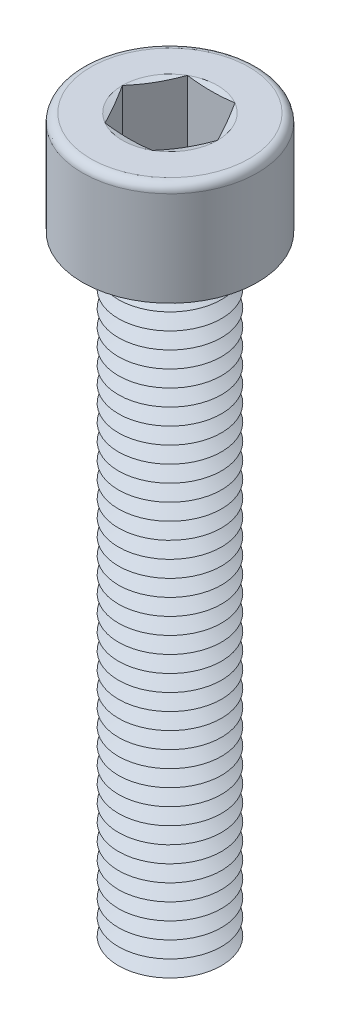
ISO-10303-21;
HEADER;
FILE_DESCRIPTION(('STEP AP214'),'2;1');
FILE_NAME('part.step','',(''),(''),'','','');
FILE_SCHEMA(('AUTOMOTIVE_DESIGN { 1 0 10303 214 1 1 1 1 }'));
ENDSEC;
DATA;
#1=APPLICATION_CONTEXT('core data for automotive mechanical design processes');
#2=APPLICATION_PROTOCOL_DEFINITION('international standard','automotive_design',2000,#1);
#3=PRODUCT_CONTEXT('',#1,'mechanical');
#4=PRODUCT('Part','Part','',(#3));
#5=PRODUCT_RELATED_PRODUCT_CATEGORY('part','',(#4));
#6=PRODUCT_DEFINITION_FORMATION('','',#4);
#7=PRODUCT_DEFINITION_CONTEXT('part definition',#1,'design');
#8=PRODUCT_DEFINITION('design','',#6,#7);
#9=PRODUCT_DEFINITION_SHAPE('','',#8);
#10=(LENGTH_UNIT() NAMED_UNIT(*) SI_UNIT(.MILLI.,.METRE.));
#11=(NAMED_UNIT(*) PLANE_ANGLE_UNIT() SI_UNIT($,.RADIAN.));
#12=(NAMED_UNIT(*) SI_UNIT($,.STERADIAN.) SOLID_ANGLE_UNIT());
#13=UNCERTAINTY_MEASURE_WITH_UNIT(LENGTH_MEASURE(1.E-05),#10,'distance_accuracy_value','');
#14=(GEOMETRIC_REPRESENTATION_CONTEXT(3) GLOBAL_UNCERTAINTY_ASSIGNED_CONTEXT((#13)) GLOBAL_UNIT_ASSIGNED_CONTEXT((#10,
#11,#12)) REPRESENTATION_CONTEXT('',''));
#15=CARTESIAN_POINT('',(0.,0.,0.));
#16=DIRECTION('',(0.,0.,1.));
#17=DIRECTION('',(1.,0.,0.));
#18=AXIS2_PLACEMENT_3D('',#15,#16,#17);
#19=CARTESIAN_POINT('',(0.,3.2,0.));
#20=DIRECTION('',(0.,1.,0.));
#21=DIRECTION('',(0.,0.,1.));
#22=AXIS2_PLACEMENT_3D('',#19,#20,#21);
#23=CONICAL_SURFACE('',#22,1.80717967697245,1.0471975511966);
#24=CARTESIAN_POINT('',(0.,3.6,0.));
#25=DIRECTION('',(0.,1.,0.));
#26=DIRECTION('',(0.,0.,1.));
#27=AXIS2_PLACEMENT_3D('',#24,#25,#26);
#28=CIRCLE('',#27,2.5);
#29=CARTESIAN_POINT('',(0.,3.6,2.5));
#30=VERTEX_POINT('',#29);
#31=EDGE_CURVE('E607',#30,#30,#28,.T.);
#32=ORIENTED_EDGE('',*,*,#31,.F.);
#33=EDGE_LOOP('',(#32));
#34=FACE_BOUND('',#33,.T.);
#35=CARTESIAN_POINT('',(0.,3.2,0.));
#36=DIRECTION('',(0.,1.,0.));
#37=DIRECTION('',(0.,0.,1.));
#38=AXIS2_PLACEMENT_3D('',#35,#36,#37);
#39=CIRCLE('',#38,1.80717967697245);
#40=CARTESIAN_POINT('',(0.,3.2,1.80717967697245));
#41=VERTEX_POINT('',#40);
#42=EDGE_CURVE('E611',#41,#41,#39,.T.);
#43=ORIENTED_EDGE('',*,*,#42,.T.);
#44=EDGE_LOOP('',(#43));
#45=FACE_BOUND('',#44,.T.);
#46=ADVANCED_FACE('F41',(#34,#45),#23,.T.);
#47=CARTESIAN_POINT('',(0.,2.8,0.));
#48=DIRECTION('',(0.,-1.,0.));
#49=DIRECTION('',(0.,0.,-1.));
#50=AXIS2_PLACEMENT_3D('',#47,#48,#49);
#51=CONICAL_SURFACE('',#50,2.5,1.0471975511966);
#52=ORIENTED_EDGE('',*,*,#42,.F.);
#53=EDGE_LOOP('',(#52));
#54=FACE_BOUND('',#53,.T.);
#55=CARTESIAN_POINT('',(0.,2.8,0.));
#56=DIRECTION('',(0.,1.,0.));
#57=DIRECTION('',(0.,0.,1.));
#58=AXIS2_PLACEMENT_3D('',#55,#56,#57);
#59=CIRCLE('',#58,2.5);
#60=CARTESIAN_POINT('',(0.,2.8,2.5));
#61=VERTEX_POINT('',#60);
#62=EDGE_CURVE('E615',#61,#61,#59,.T.);
#63=ORIENTED_EDGE('',*,*,#62,.T.);
#64=EDGE_LOOP('',(#63));
#65=FACE_BOUND('',#64,.T.);
#66=ADVANCED_FACE('F248',(#54,#65),#51,.T.);
#67=CARTESIAN_POINT('',(0.,0.,0.));
#68=DIRECTION('',(0.,1.,0.));
#69=DIRECTION('',(0.,0.,1.));
#70=AXIS2_PLACEMENT_3D('',#67,#68,#69);
#71=PLANE('',#70);
#72=CARTESIAN_POINT('',(0.,0.,0.));
#73=DIRECTION('',(0.,1.,0.));
#74=DIRECTION('',(0.,0.,1.));
#75=AXIS2_PLACEMENT_3D('',#72,#73,#74);
#76=CIRCLE('',#75,1.80717967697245);
#77=CARTESIAN_POINT('',(0.,0.,1.80717967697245));
#78=VERTEX_POINT('',#77);
#79=EDGE_CURVE('E642',#78,#78,#76,.T.);
#80=ORIENTED_EDGE('',*,*,#79,.F.);
#81=EDGE_LOOP('',(#80));
#82=FACE_BOUND('',#81,.T.);
#83=ADVANCED_FACE('F245',(#82),#71,.F.);
#84=CARTESIAN_POINT('',(0.,0.,0.));
#85=DIRECTION('',(0.,1.,0.));
#86=DIRECTION('',(0.,0.,1.));
#87=AXIS2_PLACEMENT_3D('',#84,#85,#86);
#88=CONICAL_SURFACE('',#87,1.80717967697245,1.0471975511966);
#89=CARTESIAN_POINT('',(0.,0.399999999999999,0.));
#90=DIRECTION('',(0.,1.,0.));
#91=DIRECTION('',(0.,0.,1.));
#92=AXIS2_PLACEMENT_3D('',#89,#90,#91);
#93=CIRCLE('',#92,2.5);
#94=CARTESIAN_POINT('',(0.,0.399999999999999,2.5));
#95=VERTEX_POINT('',#94);
#96=EDGE_CURVE('E638',#95,#95,#93,.T.);
#97=ORIENTED_EDGE('',*,*,#96,.F.);
#98=EDGE_LOOP('',(#97));
#99=FACE_BOUND('',#98,.T.);
#100=ORIENTED_EDGE('',*,*,#79,.T.);
#101=EDGE_LOOP('',(#100));
#102=FACE_BOUND('',#101,.T.);
#103=ADVANCED_FACE('F247',(#99,#102),#88,.T.);
#104=CARTESIAN_POINT('',(0.,0.399999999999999,0.));
#105=DIRECTION('',(0.,-1.,0.));
#106=DIRECTION('',(0.,0.,-1.));
#107=AXIS2_PLACEMENT_3D('',#104,#105,#106);
#108=CONICAL_SURFACE('',#107,2.5,1.0471975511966);
#109=CARTESIAN_POINT('',(0.,0.8,0.));
#110=DIRECTION('',(0.,1.,0.));
#111=DIRECTION('',(0.,0.,1.));
#112=AXIS2_PLACEMENT_3D('',#109,#110,#111);
#113=CIRCLE('',#112,1.80717967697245);
#114=CARTESIAN_POINT('',(0.,0.8,1.80717967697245));
#115=VERTEX_POINT('',#114);
#116=EDGE_CURVE('E634',#115,#115,#113,.T.);
#117=ORIENTED_EDGE('',*,*,#116,.F.);
#118=EDGE_LOOP('',(#117));
#119=FACE_BOUND('',#118,.T.);
#120=ORIENTED_EDGE('',*,*,#96,.T.);
#121=EDGE_LOOP('',(#120));
#122=FACE_BOUND('',#121,.T.);
#123=ADVANCED_FACE('F254',(#119,#122),#108,.T.);
#124=CARTESIAN_POINT('',(0.,0.8,0.));
#125=DIRECTION('',(0.,1.,0.));
#126=DIRECTION('',(0.,0.,1.));
#127=AXIS2_PLACEMENT_3D('',#124,#125,#126);
#128=CONICAL_SURFACE('',#127,1.80717967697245,1.0471975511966);
#129=CARTESIAN_POINT('',(0.,1.2,0.));
#130=DIRECTION('',(0.,1.,0.));
#131=DIRECTION('',(0.,0.,1.));
#132=AXIS2_PLACEMENT_3D('',#129,#130,#131);
#133=CIRCLE('',#132,2.5);
#134=CARTESIAN_POINT('',(0.,1.2,2.5));
#135=VERTEX_POINT('',#134);
#136=EDGE_CURVE('E630',#135,#135,#133,.T.);
#137=ORIENTED_EDGE('',*,*,#136,.F.);
#138=EDGE_LOOP('',(#137));
#139=FACE_BOUND('',#138,.T.);
#140=ORIENTED_EDGE('',*,*,#116,.T.);
#141=EDGE_LOOP('',(#140));
#142=FACE_BOUND('',#141,.T.);
#143=ADVANCED_FACE('F282',(#139,#142),#128,.T.);
#144=CARTESIAN_POINT('',(0.,1.2,0.));
#145=DIRECTION('',(0.,-1.,0.));
#146=DIRECTION('',(0.,0.,-1.));
#147=AXIS2_PLACEMENT_3D('',#144,#145,#146);
#148=CONICAL_SURFACE('',#147,2.5,1.0471975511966);
#149=CARTESIAN_POINT('',(0.,1.6,0.));
#150=DIRECTION('',(0.,1.,0.));
#151=DIRECTION('',(0.,0.,1.));
#152=AXIS2_PLACEMENT_3D('',#149,#150,#151);
#153=CIRCLE('',#152,1.80717967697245);
#154=CARTESIAN_POINT('',(0.,1.6,1.80717967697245));
#155=VERTEX_POINT('',#154);
#156=EDGE_CURVE('E626',#155,#155,#153,.T.);
#157=ORIENTED_EDGE('',*,*,#156,.F.);
#158=EDGE_LOOP('',(#157));
#159=FACE_BOUND('',#158,.T.);
#160=ORIENTED_EDGE('',*,*,#136,.T.);
#161=EDGE_LOOP('',(#160));
#162=FACE_BOUND('',#161,.T.);
#163=ADVANCED_FACE('F279',(#159,#162),#148,.T.);
#164=CARTESIAN_POINT('',(0.,1.6,0.));
#165=DIRECTION('',(0.,1.,0.));
#166=DIRECTION('',(0.,0.,1.));
#167=AXIS2_PLACEMENT_3D('',#164,#165,#166);
#168=CONICAL_SURFACE('',#167,1.80717967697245,1.0471975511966);
#169=CARTESIAN_POINT('',(0.,2.,0.));
#170=DIRECTION('',(0.,1.,0.));
#171=DIRECTION('',(0.,0.,1.));
#172=AXIS2_PLACEMENT_3D('',#169,#170,#171);
#173=CIRCLE('',#172,2.5);
#174=CARTESIAN_POINT('',(0.,2.,2.5));
#175=VERTEX_POINT('',#174);
#176=EDGE_CURVE('E622',#175,#175,#173,.T.);
#177=ORIENTED_EDGE('',*,*,#176,.F.);
#178=EDGE_LOOP('',(#177));
#179=FACE_BOUND('',#178,.T.);
#180=ORIENTED_EDGE('',*,*,#156,.T.);
#181=EDGE_LOOP('',(#180));
#182=FACE_BOUND('',#181,.T.);
#183=ADVANCED_FACE('F273',(#179,#182),#168,.T.);
#184=CARTESIAN_POINT('',(0.,2.,0.));
#185=DIRECTION('',(0.,-1.,0.));
#186=DIRECTION('',(0.,0.,-1.));
#187=AXIS2_PLACEMENT_3D('',#184,#185,#186);
#188=CONICAL_SURFACE('',#187,2.5,1.0471975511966);
#189=CARTESIAN_POINT('',(0.,2.4,0.));
#190=DIRECTION('',(0.,1.,0.));
#191=DIRECTION('',(0.,0.,1.));
#192=AXIS2_PLACEMENT_3D('',#189,#190,#191);
#193=CIRCLE('',#192,1.80717967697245);
#194=CARTESIAN_POINT('',(0.,2.4,1.80717967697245));
#195=VERTEX_POINT('',#194);
#196=EDGE_CURVE('E618',#195,#195,#193,.T.);
#197=ORIENTED_EDGE('',*,*,#196,.F.);
#198=EDGE_LOOP('',(#197));
#199=FACE_BOUND('',#198,.T.);
#200=ORIENTED_EDGE('',*,*,#176,.T.);
#201=EDGE_LOOP('',(#200));
#202=FACE_BOUND('',#201,.T.);
#203=ADVANCED_FACE('F269',(#199,#202),#188,.T.);
#204=CARTESIAN_POINT('',(0.,2.4,0.));
#205=DIRECTION('',(0.,1.,0.));
#206=DIRECTION('',(0.,0.,1.));
#207=AXIS2_PLACEMENT_3D('',#204,#205,#206);
#208=CONICAL_SURFACE('',#207,1.80717967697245,1.0471975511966);
#209=ORIENTED_EDGE('',*,*,#62,.F.);
#210=EDGE_LOOP('',(#209));
#211=FACE_BOUND('',#210,.T.);
#212=ORIENTED_EDGE('',*,*,#196,.T.);
#213=EDGE_LOOP('',(#212));
#214=FACE_BOUND('',#213,.T.);
#215=ADVANCED_FACE('F272',(#211,#214),#208,.T.);
#216=CARTESIAN_POINT('',(0.,4.,0.));
#217=DIRECTION('',(0.,1.,0.));
#218=DIRECTION('',(0.,0.,1.));
#219=AXIS2_PLACEMENT_3D('',#216,#217,#218);
#220=CONICAL_SURFACE('',#219,1.80717967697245,1.0471975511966);
#221=CARTESIAN_POINT('',(0.,4.4,0.));
#222=DIRECTION('',(0.,1.,0.));
#223=DIRECTION('',(0.,0.,1.));
#224=AXIS2_PLACEMENT_3D('',#221,#222,#223);
#225=CIRCLE('',#224,2.5);
#226=CARTESIAN_POINT('',(0.,4.4,2.5));
#227=VERTEX_POINT('',#226);
#228=EDGE_CURVE('E599',#227,#227,#225,.T.);
#229=ORIENTED_EDGE('',*,*,#228,.F.);
#230=EDGE_LOOP('',(#229));
#231=FACE_BOUND('',#230,.T.);
#232=CARTESIAN_POINT('',(0.,4.,0.));
#233=DIRECTION('',(0.,1.,0.));
#234=DIRECTION('',(0.,0.,1.));
#235=AXIS2_PLACEMENT_3D('',#232,#233,#234);
#236=CIRCLE('',#235,1.80717967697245);
#237=CARTESIAN_POINT('',(0.,4.,1.80717967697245));
#238=VERTEX_POINT('',#237);
#239=EDGE_CURVE('E603',#238,#238,#236,.T.);
#240=ORIENTED_EDGE('',*,*,#239,.T.);
#241=EDGE_LOOP('',(#240));
#242=FACE_BOUND('',#241,.T.);
#243=ADVANCED_FACE('F277',(#231,#242),#220,.T.);
#244=CARTESIAN_POINT('',(0.,3.6,0.));
#245=DIRECTION('',(0.,-1.,0.));
#246=DIRECTION('',(0.,0.,-1.));
#247=AXIS2_PLACEMENT_3D('',#244,#245,#246);
#248=CONICAL_SURFACE('',#247,2.5,1.0471975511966);
#249=ORIENTED_EDGE('',*,*,#239,.F.);
#250=EDGE_LOOP('',(#249));
#251=FACE_BOUND('',#250,.T.);
#252=ORIENTED_EDGE('',*,*,#31,.T.);
#253=EDGE_LOOP('',(#252));
#254=FACE_BOUND('',#253,.T.);
#255=ADVANCED_FACE('F1343',(#251,#254),#248,.T.);
#256=CARTESIAN_POINT('',(0.,4.8,0.));
#257=DIRECTION('',(0.,1.,0.));
#258=DIRECTION('',(0.,0.,1.));
#259=AXIS2_PLACEMENT_3D('',#256,#257,#258);
#260=CONICAL_SURFACE('',#259,1.80717967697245,1.0471975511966);
#261=CARTESIAN_POINT('',(0.,5.2,0.));
#262=DIRECTION('',(0.,1.,0.));
#263=DIRECTION('',(0.,0.,1.));
#264=AXIS2_PLACEMENT_3D('',#261,#262,#263);
#265=CIRCLE('',#264,2.5);
#266=CARTESIAN_POINT('',(0.,5.2,2.5));
#267=VERTEX_POINT('',#266);
#268=EDGE_CURVE('E591',#267,#267,#265,.T.);
#269=ORIENTED_EDGE('',*,*,#268,.F.);
#270=EDGE_LOOP('',(#269));
#271=FACE_BOUND('',#270,.T.);
#272=CARTESIAN_POINT('',(0.,4.8,0.));
#273=DIRECTION('',(0.,1.,0.));
#274=DIRECTION('',(0.,0.,1.));
#275=AXIS2_PLACEMENT_3D('',#272,#273,#274);
#276=CIRCLE('',#275,1.80717967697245);
#277=CARTESIAN_POINT('',(0.,4.8,1.80717967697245));
#278=VERTEX_POINT('',#277);
#279=EDGE_CURVE('E595',#278,#278,#276,.T.);
#280=ORIENTED_EDGE('',*,*,#279,.T.);
#281=EDGE_LOOP('',(#280));
#282=FACE_BOUND('',#281,.T.);
#283=ADVANCED_FACE('F1334',(#271,#282),#260,.T.);
#284=CARTESIAN_POINT('',(0.,4.4,0.));
#285=DIRECTION('',(0.,-1.,0.));
#286=DIRECTION('',(0.,0.,-1.));
#287=AXIS2_PLACEMENT_3D('',#284,#285,#286);
#288=CONICAL_SURFACE('',#287,2.5,1.0471975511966);
#289=ORIENTED_EDGE('',*,*,#279,.F.);
#290=EDGE_LOOP('',(#289));
#291=FACE_BOUND('',#290,.T.);
#292=ORIENTED_EDGE('',*,*,#228,.T.);
#293=EDGE_LOOP('',(#292));
#294=FACE_BOUND('',#293,.T.);
#295=ADVANCED_FACE('F1325',(#291,#294),#288,.T.);
#296=CARTESIAN_POINT('',(0.,5.6,0.));
#297=DIRECTION('',(0.,1.,0.));
#298=DIRECTION('',(0.,0.,1.));
#299=AXIS2_PLACEMENT_3D('',#296,#297,#298);
#300=CONICAL_SURFACE('',#299,1.80717967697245,1.0471975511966);
#301=CARTESIAN_POINT('',(0.,6.,0.));
#302=DIRECTION('',(0.,1.,0.));
#303=DIRECTION('',(0.,0.,1.));
#304=AXIS2_PLACEMENT_3D('',#301,#302,#303);
#305=CIRCLE('',#304,2.5);
#306=CARTESIAN_POINT('',(0.,6.,2.5));
#307=VERTEX_POINT('',#306);
#308=EDGE_CURVE('E583',#307,#307,#305,.T.);
#309=ORIENTED_EDGE('',*,*,#308,.F.);
#310=EDGE_LOOP('',(#309));
#311=FACE_BOUND('',#310,.T.);
#312=CARTESIAN_POINT('',(0.,5.6,0.));
#313=DIRECTION('',(0.,1.,0.));
#314=DIRECTION('',(0.,0.,1.));
#315=AXIS2_PLACEMENT_3D('',#312,#313,#314);
#316=CIRCLE('',#315,1.80717967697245);
#317=CARTESIAN_POINT('',(0.,5.6,1.80717967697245));
#318=VERTEX_POINT('',#317);
#319=EDGE_CURVE('E587',#318,#318,#316,.T.);
#320=ORIENTED_EDGE('',*,*,#319,.T.);
#321=EDGE_LOOP('',(#320));
#322=FACE_BOUND('',#321,.T.);
#323=ADVANCED_FACE('F1316',(#311,#322),#300,.T.);
#324=CARTESIAN_POINT('',(0.,5.2,0.));
#325=DIRECTION('',(0.,-1.,0.));
#326=DIRECTION('',(0.,0.,-1.));
#327=AXIS2_PLACEMENT_3D('',#324,#325,#326);
#328=CONICAL_SURFACE('',#327,2.5,1.0471975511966);
#329=ORIENTED_EDGE('',*,*,#319,.F.);
#330=EDGE_LOOP('',(#329));
#331=FACE_BOUND('',#330,.T.);
#332=ORIENTED_EDGE('',*,*,#268,.T.);
#333=EDGE_LOOP('',(#332));
#334=FACE_BOUND('',#333,.T.);
#335=ADVANCED_FACE('F1307',(#331,#334),#328,.T.);
#336=CARTESIAN_POINT('',(0.,6.4,0.));
#337=DIRECTION('',(0.,1.,0.));
#338=DIRECTION('',(0.,0.,1.));
#339=AXIS2_PLACEMENT_3D('',#336,#337,#338);
#340=CONICAL_SURFACE('',#339,1.80717967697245,1.0471975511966);
#341=CARTESIAN_POINT('',(0.,6.8,0.));
#342=DIRECTION('',(0.,1.,0.));
#343=DIRECTION('',(0.,0.,1.));
#344=AXIS2_PLACEMENT_3D('',#341,#342,#343);
#345=CIRCLE('',#344,2.5);
#346=CARTESIAN_POINT('',(0.,6.8,2.5));
#347=VERTEX_POINT('',#346);
#348=EDGE_CURVE('E575',#347,#347,#345,.T.);
#349=ORIENTED_EDGE('',*,*,#348,.F.);
#350=EDGE_LOOP('',(#349));
#351=FACE_BOUND('',#350,.T.);
#352=CARTESIAN_POINT('',(0.,6.4,0.));
#353=DIRECTION('',(0.,1.,0.));
#354=DIRECTION('',(0.,0.,1.));
#355=AXIS2_PLACEMENT_3D('',#352,#353,#354);
#356=CIRCLE('',#355,1.80717967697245);
#357=CARTESIAN_POINT('',(0.,6.4,1.80717967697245));
#358=VERTEX_POINT('',#357);
#359=EDGE_CURVE('E579',#358,#358,#356,.T.);
#360=ORIENTED_EDGE('',*,*,#359,.T.);
#361=EDGE_LOOP('',(#360));
#362=FACE_BOUND('',#361,.T.);
#363=ADVANCED_FACE('F1298',(#351,#362),#340,.T.);
#364=CARTESIAN_POINT('',(0.,6.,0.));
#365=DIRECTION('',(0.,-1.,0.));
#366=DIRECTION('',(0.,0.,-1.));
#367=AXIS2_PLACEMENT_3D('',#364,#365,#366);
#368=CONICAL_SURFACE('',#367,2.5,1.0471975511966);
#369=ORIENTED_EDGE('',*,*,#359,.F.);
#370=EDGE_LOOP('',(#369));
#371=FACE_BOUND('',#370,.T.);
#372=ORIENTED_EDGE('',*,*,#308,.T.);
#373=EDGE_LOOP('',(#372));
#374=FACE_BOUND('',#373,.T.);
#375=ADVANCED_FACE('F1289',(#371,#374),#368,.T.);
#376=CARTESIAN_POINT('',(0.,7.2,0.));
#377=DIRECTION('',(0.,1.,0.));
#378=DIRECTION('',(0.,0.,1.));
#379=AXIS2_PLACEMENT_3D('',#376,#377,#378);
#380=CONICAL_SURFACE('',#379,1.80717967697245,1.0471975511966);
#381=CARTESIAN_POINT('',(0.,7.6,0.));
#382=DIRECTION('',(0.,1.,0.));
#383=DIRECTION('',(0.,0.,1.));
#384=AXIS2_PLACEMENT_3D('',#381,#382,#383);
#385=CIRCLE('',#384,2.5);
#386=CARTESIAN_POINT('',(0.,7.6,2.5));
#387=VERTEX_POINT('',#386);
#388=EDGE_CURVE('E567',#387,#387,#385,.T.);
#389=ORIENTED_EDGE('',*,*,#388,.F.);
#390=EDGE_LOOP('',(#389));
#391=FACE_BOUND('',#390,.T.);
#392=CARTESIAN_POINT('',(0.,7.2,0.));
#393=DIRECTION('',(0.,1.,0.));
#394=DIRECTION('',(0.,0.,1.));
#395=AXIS2_PLACEMENT_3D('',#392,#393,#394);
#396=CIRCLE('',#395,1.80717967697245);
#397=CARTESIAN_POINT('',(0.,7.2,1.80717967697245));
#398=VERTEX_POINT('',#397);
#399=EDGE_CURVE('E571',#398,#398,#396,.T.);
#400=ORIENTED_EDGE('',*,*,#399,.T.);
#401=EDGE_LOOP('',(#400));
#402=FACE_BOUND('',#401,.T.);
#403=ADVANCED_FACE('F1280',(#391,#402),#380,.T.);
#404=CARTESIAN_POINT('',(0.,6.8,0.));
#405=DIRECTION('',(0.,-1.,0.));
#406=DIRECTION('',(0.,0.,-1.));
#407=AXIS2_PLACEMENT_3D('',#404,#405,#406);
#408=CONICAL_SURFACE('',#407,2.5,1.0471975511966);
#409=ORIENTED_EDGE('',*,*,#399,.F.);
#410=EDGE_LOOP('',(#409));
#411=FACE_BOUND('',#410,.T.);
#412=ORIENTED_EDGE('',*,*,#348,.T.);
#413=EDGE_LOOP('',(#412));
#414=FACE_BOUND('',#413,.T.);
#415=ADVANCED_FACE('F1271',(#411,#414),#408,.T.);
#416=CARTESIAN_POINT('',(0.,8.,0.));
#417=DIRECTION('',(0.,1.,0.));
#418=DIRECTION('',(0.,0.,1.));
#419=AXIS2_PLACEMENT_3D('',#416,#417,#418);
#420=CONICAL_SURFACE('',#419,1.80717967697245,1.0471975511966);
#421=CARTESIAN_POINT('',(0.,8.4,0.));
#422=DIRECTION('',(0.,1.,0.));
#423=DIRECTION('',(0.,0.,1.));
#424=AXIS2_PLACEMENT_3D('',#421,#422,#423);
#425=CIRCLE('',#424,2.5);
#426=CARTESIAN_POINT('',(0.,8.4,2.5));
#427=VERTEX_POINT('',#426);
#428=EDGE_CURVE('E559',#427,#427,#425,.T.);
#429=ORIENTED_EDGE('',*,*,#428,.F.);
#430=EDGE_LOOP('',(#429));
#431=FACE_BOUND('',#430,.T.);
#432=CARTESIAN_POINT('',(0.,8.,0.));
#433=DIRECTION('',(0.,1.,0.));
#434=DIRECTION('',(0.,0.,1.));
#435=AXIS2_PLACEMENT_3D('',#432,#433,#434);
#436=CIRCLE('',#435,1.80717967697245);
#437=CARTESIAN_POINT('',(0.,8.,1.80717967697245));
#438=VERTEX_POINT('',#437);
#439=EDGE_CURVE('E563',#438,#438,#436,.T.);
#440=ORIENTED_EDGE('',*,*,#439,.T.);
#441=EDGE_LOOP('',(#440));
#442=FACE_BOUND('',#441,.T.);
#443=ADVANCED_FACE('F1262',(#431,#442),#420,.T.);
#444=CARTESIAN_POINT('',(0.,7.6,0.));
#445=DIRECTION('',(0.,-1.,0.));
#446=DIRECTION('',(0.,0.,-1.));
#447=AXIS2_PLACEMENT_3D('',#444,#445,#446);
#448=CONICAL_SURFACE('',#447,2.5,1.0471975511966);
#449=ORIENTED_EDGE('',*,*,#439,.F.);
#450=EDGE_LOOP('',(#449));
#451=FACE_BOUND('',#450,.T.);
#452=ORIENTED_EDGE('',*,*,#388,.T.);
#453=EDGE_LOOP('',(#452));
#454=FACE_BOUND('',#453,.T.);
#455=ADVANCED_FACE('F1253',(#451,#454),#448,.T.);
#456=CARTESIAN_POINT('',(0.,8.8,0.));
#457=DIRECTION('',(0.,1.,0.));
#458=DIRECTION('',(0.,0.,1.));
#459=AXIS2_PLACEMENT_3D('',#456,#457,#458);
#460=CONICAL_SURFACE('',#459,1.80717967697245,1.0471975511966);
#461=CARTESIAN_POINT('',(0.,9.2,0.));
#462=DIRECTION('',(0.,1.,0.));
#463=DIRECTION('',(0.,0.,1.));
#464=AXIS2_PLACEMENT_3D('',#461,#462,#463);
#465=CIRCLE('',#464,2.5);
#466=CARTESIAN_POINT('',(0.,9.2,2.5));
#467=VERTEX_POINT('',#466);
#468=EDGE_CURVE('E551',#467,#467,#465,.T.);
#469=ORIENTED_EDGE('',*,*,#468,.F.);
#470=EDGE_LOOP('',(#469));
#471=FACE_BOUND('',#470,.T.);
#472=CARTESIAN_POINT('',(0.,8.8,0.));
#473=DIRECTION('',(0.,1.,0.));
#474=DIRECTION('',(0.,0.,1.));
#475=AXIS2_PLACEMENT_3D('',#472,#473,#474);
#476=CIRCLE('',#475,1.80717967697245);
#477=CARTESIAN_POINT('',(0.,8.8,1.80717967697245));
#478=VERTEX_POINT('',#477);
#479=EDGE_CURVE('E555',#478,#478,#476,.T.);
#480=ORIENTED_EDGE('',*,*,#479,.T.);
#481=EDGE_LOOP('',(#480));
#482=FACE_BOUND('',#481,.T.);
#483=ADVANCED_FACE('F1244',(#471,#482),#460,.T.);
#484=CARTESIAN_POINT('',(0.,8.4,0.));
#485=DIRECTION('',(0.,-1.,0.));
#486=DIRECTION('',(0.,0.,-1.));
#487=AXIS2_PLACEMENT_3D('',#484,#485,#486);
#488=CONICAL_SURFACE('',#487,2.5,1.0471975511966);
#489=ORIENTED_EDGE('',*,*,#479,.F.);
#490=EDGE_LOOP('',(#489));
#491=FACE_BOUND('',#490,.T.);
#492=ORIENTED_EDGE('',*,*,#428,.T.);
#493=EDGE_LOOP('',(#492));
#494=FACE_BOUND('',#493,.T.);
#495=ADVANCED_FACE('F1235',(#491,#494),#488,.T.);
#496=CARTESIAN_POINT('',(0.,9.6,0.));
#497=DIRECTION('',(0.,1.,0.));
#498=DIRECTION('',(0.,0.,1.));
#499=AXIS2_PLACEMENT_3D('',#496,#497,#498);
#500=CONICAL_SURFACE('',#499,1.80717967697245,1.0471975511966);
#501=CARTESIAN_POINT('',(0.,10.,0.));
#502=DIRECTION('',(0.,1.,0.));
#503=DIRECTION('',(0.,0.,1.));
#504=AXIS2_PLACEMENT_3D('',#501,#502,#503);
#505=CIRCLE('',#504,2.5);
#506=CARTESIAN_POINT('',(0.,10.,2.5));
#507=VERTEX_POINT('',#506);
#508=EDGE_CURVE('E543',#507,#507,#505,.T.);
#509=ORIENTED_EDGE('',*,*,#508,.F.);
#510=EDGE_LOOP('',(#509));
#511=FACE_BOUND('',#510,.T.);
#512=CARTESIAN_POINT('',(0.,9.6,0.));
#513=DIRECTION('',(0.,1.,0.));
#514=DIRECTION('',(0.,0.,1.));
#515=AXIS2_PLACEMENT_3D('',#512,#513,#514);
#516=CIRCLE('',#515,1.80717967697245);
#517=CARTESIAN_POINT('',(0.,9.6,1.80717967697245));
#518=VERTEX_POINT('',#517);
#519=EDGE_CURVE('E547',#518,#518,#516,.T.);
#520=ORIENTED_EDGE('',*,*,#519,.T.);
#521=EDGE_LOOP('',(#520));
#522=FACE_BOUND('',#521,.T.);
#523=ADVANCED_FACE('F1226',(#511,#522),#500,.T.);
#524=CARTESIAN_POINT('',(0.,9.2,0.));
#525=DIRECTION('',(0.,-1.,0.));
#526=DIRECTION('',(0.,0.,-1.));
#527=AXIS2_PLACEMENT_3D('',#524,#525,#526);
#528=CONICAL_SURFACE('',#527,2.5,1.0471975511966);
#529=ORIENTED_EDGE('',*,*,#519,.F.);
#530=EDGE_LOOP('',(#529));
#531=FACE_BOUND('',#530,.T.);
#532=ORIENTED_EDGE('',*,*,#468,.T.);
#533=EDGE_LOOP('',(#532));
#534=FACE_BOUND('',#533,.T.);
#535=ADVANCED_FACE('F1217',(#531,#534),#528,.T.);
#536=CARTESIAN_POINT('',(0.,10.4,0.));
#537=DIRECTION('',(0.,1.,0.));
#538=DIRECTION('',(0.,0.,1.));
#539=AXIS2_PLACEMENT_3D('',#536,#537,#538);
#540=CONICAL_SURFACE('',#539,1.80717967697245,1.0471975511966);
#541=CARTESIAN_POINT('',(0.,10.8,0.));
#542=DIRECTION('',(0.,1.,0.));
#543=DIRECTION('',(0.,0.,1.));
#544=AXIS2_PLACEMENT_3D('',#541,#542,#543);
#545=CIRCLE('',#544,2.5);
#546=CARTESIAN_POINT('',(0.,10.8,2.5));
#547=VERTEX_POINT('',#546);
#548=EDGE_CURVE('E536',#547,#547,#545,.T.);
#549=ORIENTED_EDGE('',*,*,#548,.F.);
#550=EDGE_LOOP('',(#549));
#551=FACE_BOUND('',#550,.T.);
#552=CARTESIAN_POINT('',(0.,10.4,0.));
#553=DIRECTION('',(0.,1.,0.));
#554=DIRECTION('',(0.,0.,1.));
#555=AXIS2_PLACEMENT_3D('',#552,#553,#554);
#556=CIRCLE('',#555,1.80717967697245);
#557=CARTESIAN_POINT('',(0.,10.4,1.80717967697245));
#558=VERTEX_POINT('',#557);
#559=EDGE_CURVE('E540',#558,#558,#556,.T.);
#560=ORIENTED_EDGE('',*,*,#559,.T.);
#561=EDGE_LOOP('',(#560));
#562=FACE_BOUND('',#561,.T.);
#563=ADVANCED_FACE('F1208',(#551,#562),#540,.T.);
#564=CARTESIAN_POINT('',(0.,10.,0.));
#565=DIRECTION('',(0.,-1.,0.));
#566=DIRECTION('',(0.,0.,-1.));
#567=AXIS2_PLACEMENT_3D('',#564,#565,#566);
#568=CONICAL_SURFACE('',#567,2.5,1.0471975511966);
#569=ORIENTED_EDGE('',*,*,#559,.F.);
#570=EDGE_LOOP('',(#569));
#571=FACE_BOUND('',#570,.T.);
#572=ORIENTED_EDGE('',*,*,#508,.T.);
#573=EDGE_LOOP('',(#572));
#574=FACE_BOUND('',#573,.T.);
#575=ADVANCED_FACE('F1199',(#571,#574),#568,.T.);
#576=CARTESIAN_POINT('',(0.,11.2,0.));
#577=DIRECTION('',(0.,1.,0.));
#578=DIRECTION('',(0.,0.,1.));
#579=AXIS2_PLACEMENT_3D('',#576,#577,#578);
#580=CONICAL_SURFACE('',#579,1.80717967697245,1.0471975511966);
#581=CARTESIAN_POINT('',(0.,11.6,0.));
#582=DIRECTION('',(0.,1.,0.));
#583=DIRECTION('',(0.,0.,1.));
#584=AXIS2_PLACEMENT_3D('',#581,#582,#583);
#585=CIRCLE('',#584,2.5);
#586=CARTESIAN_POINT('',(0.,11.6,2.5));
#587=VERTEX_POINT('',#586);
#588=EDGE_CURVE('E528',#587,#587,#585,.T.);
#589=ORIENTED_EDGE('',*,*,#588,.F.);
#590=EDGE_LOOP('',(#589));
#591=FACE_BOUND('',#590,.T.);
#592=CARTESIAN_POINT('',(0.,11.2,0.));
#593=DIRECTION('',(0.,1.,0.));
#594=DIRECTION('',(0.,0.,1.));
#595=AXIS2_PLACEMENT_3D('',#592,#593,#594);
#596=CIRCLE('',#595,1.80717967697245);
#597=CARTESIAN_POINT('',(0.,11.2,1.80717967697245));
#598=VERTEX_POINT('',#597);
#599=EDGE_CURVE('E532',#598,#598,#596,.T.);
#600=ORIENTED_EDGE('',*,*,#599,.T.);
#601=EDGE_LOOP('',(#600));
#602=FACE_BOUND('',#601,.T.);
#603=ADVANCED_FACE('F1190',(#591,#602),#580,.T.);
#604=CARTESIAN_POINT('',(0.,10.8,0.));
#605=DIRECTION('',(0.,-1.,0.));
#606=DIRECTION('',(0.,0.,-1.));
#607=AXIS2_PLACEMENT_3D('',#604,#605,#606);
#608=CONICAL_SURFACE('',#607,2.5,1.0471975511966);
#609=ORIENTED_EDGE('',*,*,#599,.F.);
#610=EDGE_LOOP('',(#609));
#611=FACE_BOUND('',#610,.T.);
#612=ORIENTED_EDGE('',*,*,#548,.T.);
#613=EDGE_LOOP('',(#612));
#614=FACE_BOUND('',#613,.T.);
#615=ADVANCED_FACE('F1181',(#611,#614),#608,.T.);
#616=CARTESIAN_POINT('',(0.,12.,0.));
#617=DIRECTION('',(0.,1.,0.));
#618=DIRECTION('',(0.,0.,1.));
#619=AXIS2_PLACEMENT_3D('',#616,#617,#618);
#620=CONICAL_SURFACE('',#619,1.80717967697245,1.0471975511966);
#621=CARTESIAN_POINT('',(0.,12.4,0.));
#622=DIRECTION('',(0.,1.,0.));
#623=DIRECTION('',(0.,0.,1.));
#624=AXIS2_PLACEMENT_3D('',#621,#622,#623);
#625=CIRCLE('',#624,2.5);
#626=CARTESIAN_POINT('',(0.,12.4,2.5));
#627=VERTEX_POINT('',#626);
#628=EDGE_CURVE('E520',#627,#627,#625,.T.);
#629=ORIENTED_EDGE('',*,*,#628,.F.);
#630=EDGE_LOOP('',(#629));
#631=FACE_BOUND('',#630,.T.);
#632=CARTESIAN_POINT('',(0.,12.,0.));
#633=DIRECTION('',(0.,1.,0.));
#634=DIRECTION('',(0.,0.,1.));
#635=AXIS2_PLACEMENT_3D('',#632,#633,#634);
#636=CIRCLE('',#635,1.80717967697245);
#637=CARTESIAN_POINT('',(0.,12.,1.80717967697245));
#638=VERTEX_POINT('',#637);
#639=EDGE_CURVE('E524',#638,#638,#636,.T.);
#640=ORIENTED_EDGE('',*,*,#639,.T.);
#641=EDGE_LOOP('',(#640));
#642=FACE_BOUND('',#641,.T.);
#643=ADVANCED_FACE('F1172',(#631,#642),#620,.T.);
#644=CARTESIAN_POINT('',(0.,11.6,0.));
#645=DIRECTION('',(0.,-1.,0.));
#646=DIRECTION('',(0.,0.,-1.));
#647=AXIS2_PLACEMENT_3D('',#644,#645,#646);
#648=CONICAL_SURFACE('',#647,2.5,1.0471975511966);
#649=ORIENTED_EDGE('',*,*,#639,.F.);
#650=EDGE_LOOP('',(#649));
#651=FACE_BOUND('',#650,.T.);
#652=ORIENTED_EDGE('',*,*,#588,.T.);
#653=EDGE_LOOP('',(#652));
#654=FACE_BOUND('',#653,.T.);
#655=ADVANCED_FACE('F1163',(#651,#654),#648,.T.);
#656=CARTESIAN_POINT('',(0.,12.8,0.));
#657=DIRECTION('',(0.,1.,0.));
#658=DIRECTION('',(0.,0.,1.));
#659=AXIS2_PLACEMENT_3D('',#656,#657,#658);
#660=CONICAL_SURFACE('',#659,1.80717967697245,1.0471975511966);
#661=CARTESIAN_POINT('',(0.,13.2,0.));
#662=DIRECTION('',(0.,1.,0.));
#663=DIRECTION('',(0.,0.,1.));
#664=AXIS2_PLACEMENT_3D('',#661,#662,#663);
#665=CIRCLE('',#664,2.5);
#666=CARTESIAN_POINT('',(0.,13.2,2.5));
#667=VERTEX_POINT('',#666);
#668=EDGE_CURVE('E512',#667,#667,#665,.T.);
#669=ORIENTED_EDGE('',*,*,#668,.F.);
#670=EDGE_LOOP('',(#669));
#671=FACE_BOUND('',#670,.T.);
#672=CARTESIAN_POINT('',(0.,12.8,0.));
#673=DIRECTION('',(0.,1.,0.));
#674=DIRECTION('',(0.,0.,1.));
#675=AXIS2_PLACEMENT_3D('',#672,#673,#674);
#676=CIRCLE('',#675,1.80717967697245);
#677=CARTESIAN_POINT('',(0.,12.8,1.80717967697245));
#678=VERTEX_POINT('',#677);
#679=EDGE_CURVE('E516',#678,#678,#676,.T.);
#680=ORIENTED_EDGE('',*,*,#679,.T.);
#681=EDGE_LOOP('',(#680));
#682=FACE_BOUND('',#681,.T.);
#683=ADVANCED_FACE('F1154',(#671,#682),#660,.T.);
#684=CARTESIAN_POINT('',(0.,12.4,0.));
#685=DIRECTION('',(0.,-1.,0.));
#686=DIRECTION('',(0.,0.,-1.));
#687=AXIS2_PLACEMENT_3D('',#684,#685,#686);
#688=CONICAL_SURFACE('',#687,2.5,1.0471975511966);
#689=ORIENTED_EDGE('',*,*,#679,.F.);
#690=EDGE_LOOP('',(#689));
#691=FACE_BOUND('',#690,.T.);
#692=ORIENTED_EDGE('',*,*,#628,.T.);
#693=EDGE_LOOP('',(#692));
#694=FACE_BOUND('',#693,.T.);
#695=ADVANCED_FACE('F1145',(#691,#694),#688,.T.);
#696=CARTESIAN_POINT('',(0.,13.6,0.));
#697=DIRECTION('',(0.,1.,0.));
#698=DIRECTION('',(0.,0.,1.));
#699=AXIS2_PLACEMENT_3D('',#696,#697,#698);
#700=CONICAL_SURFACE('',#699,1.80717967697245,1.0471975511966);
#701=CARTESIAN_POINT('',(0.,14.,0.));
#702=DIRECTION('',(0.,1.,0.));
#703=DIRECTION('',(0.,0.,1.));
#704=AXIS2_PLACEMENT_3D('',#701,#702,#703);
#705=CIRCLE('',#704,2.5);
#706=CARTESIAN_POINT('',(0.,14.,2.5));
#707=VERTEX_POINT('',#706);
#708=EDGE_CURVE('E504',#707,#707,#705,.T.);
#709=ORIENTED_EDGE('',*,*,#708,.F.);
#710=EDGE_LOOP('',(#709));
#711=FACE_BOUND('',#710,.T.);
#712=CARTESIAN_POINT('',(0.,13.6,0.));
#713=DIRECTION('',(0.,1.,0.));
#714=DIRECTION('',(0.,0.,1.));
#715=AXIS2_PLACEMENT_3D('',#712,#713,#714);
#716=CIRCLE('',#715,1.80717967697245);
#717=CARTESIAN_POINT('',(0.,13.6,1.80717967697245));
#718=VERTEX_POINT('',#717);
#719=EDGE_CURVE('E508',#718,#718,#716,.T.);
#720=ORIENTED_EDGE('',*,*,#719,.T.);
#721=EDGE_LOOP('',(#720));
#722=FACE_BOUND('',#721,.T.);
#723=ADVANCED_FACE('F1136',(#711,#722),#700,.T.);
#724=CARTESIAN_POINT('',(0.,13.2,0.));
#725=DIRECTION('',(0.,-1.,0.));
#726=DIRECTION('',(0.,0.,-1.));
#727=AXIS2_PLACEMENT_3D('',#724,#725,#726);
#728=CONICAL_SURFACE('',#727,2.5,1.0471975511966);
#729=ORIENTED_EDGE('',*,*,#719,.F.);
#730=EDGE_LOOP('',(#729));
#731=FACE_BOUND('',#730,.T.);
#732=ORIENTED_EDGE('',*,*,#668,.T.);
#733=EDGE_LOOP('',(#732));
#734=FACE_BOUND('',#733,.T.);
#735=ADVANCED_FACE('F1127',(#731,#734),#728,.T.);
#736=CARTESIAN_POINT('',(0.,14.4,0.));
#737=DIRECTION('',(0.,1.,0.));
#738=DIRECTION('',(0.,0.,1.));
#739=AXIS2_PLACEMENT_3D('',#736,#737,#738);
#740=CONICAL_SURFACE('',#739,1.80717967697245,1.0471975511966);
#741=CARTESIAN_POINT('',(0.,14.8,0.));
#742=DIRECTION('',(0.,1.,0.));
#743=DIRECTION('',(0.,0.,1.));
#744=AXIS2_PLACEMENT_3D('',#741,#742,#743);
#745=CIRCLE('',#744,2.5);
#746=CARTESIAN_POINT('',(0.,14.8,2.5));
#747=VERTEX_POINT('',#746);
#748=EDGE_CURVE('E496',#747,#747,#745,.T.);
#749=ORIENTED_EDGE('',*,*,#748,.F.);
#750=EDGE_LOOP('',(#749));
#751=FACE_BOUND('',#750,.T.);
#752=CARTESIAN_POINT('',(0.,14.4,0.));
#753=DIRECTION('',(0.,1.,0.));
#754=DIRECTION('',(0.,0.,1.));
#755=AXIS2_PLACEMENT_3D('',#752,#753,#754);
#756=CIRCLE('',#755,1.80717967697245);
#757=CARTESIAN_POINT('',(0.,14.4,1.80717967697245));
#758=VERTEX_POINT('',#757);
#759=EDGE_CURVE('E500',#758,#758,#756,.T.);
#760=ORIENTED_EDGE('',*,*,#759,.T.);
#761=EDGE_LOOP('',(#760));
#762=FACE_BOUND('',#761,.T.);
#763=ADVANCED_FACE('F1118',(#751,#762),#740,.T.);
#764=CARTESIAN_POINT('',(0.,14.,0.));
#765=DIRECTION('',(0.,-1.,0.));
#766=DIRECTION('',(0.,0.,-1.));
#767=AXIS2_PLACEMENT_3D('',#764,#765,#766);
#768=CONICAL_SURFACE('',#767,2.5,1.0471975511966);
#769=ORIENTED_EDGE('',*,*,#759,.F.);
#770=EDGE_LOOP('',(#769));
#771=FACE_BOUND('',#770,.T.);
#772=ORIENTED_EDGE('',*,*,#708,.T.);
#773=EDGE_LOOP('',(#772));
#774=FACE_BOUND('',#773,.T.);
#775=ADVANCED_FACE('F1109',(#771,#774),#768,.T.);
#776=CARTESIAN_POINT('',(0.,15.2,0.));
#777=DIRECTION('',(0.,1.,0.));
#778=DIRECTION('',(0.,0.,1.));
#779=AXIS2_PLACEMENT_3D('',#776,#777,#778);
#780=CONICAL_SURFACE('',#779,1.80717967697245,1.0471975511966);
#781=CARTESIAN_POINT('',(0.,15.6,0.));
#782=DIRECTION('',(0.,1.,0.));
#783=DIRECTION('',(0.,0.,1.));
#784=AXIS2_PLACEMENT_3D('',#781,#782,#783);
#785=CIRCLE('',#784,2.5);
#786=CARTESIAN_POINT('',(0.,15.6,2.5));
#787=VERTEX_POINT('',#786);
#788=EDGE_CURVE('E488',#787,#787,#785,.T.);
#789=ORIENTED_EDGE('',*,*,#788,.F.);
#790=EDGE_LOOP('',(#789));
#791=FACE_BOUND('',#790,.T.);
#792=CARTESIAN_POINT('',(0.,15.2,0.));
#793=DIRECTION('',(0.,1.,0.));
#794=DIRECTION('',(0.,0.,1.));
#795=AXIS2_PLACEMENT_3D('',#792,#793,#794);
#796=CIRCLE('',#795,1.80717967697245);
#797=CARTESIAN_POINT('',(0.,15.2,1.80717967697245));
#798=VERTEX_POINT('',#797);
#799=EDGE_CURVE('E492',#798,#798,#796,.T.);
#800=ORIENTED_EDGE('',*,*,#799,.T.);
#801=EDGE_LOOP('',(#800));
#802=FACE_BOUND('',#801,.T.);
#803=ADVANCED_FACE('F1100',(#791,#802),#780,.T.);
#804=CARTESIAN_POINT('',(0.,14.8,0.));
#805=DIRECTION('',(0.,-1.,0.));
#806=DIRECTION('',(0.,0.,-1.));
#807=AXIS2_PLACEMENT_3D('',#804,#805,#806);
#808=CONICAL_SURFACE('',#807,2.5,1.0471975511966);
#809=ORIENTED_EDGE('',*,*,#799,.F.);
#810=EDGE_LOOP('',(#809));
#811=FACE_BOUND('',#810,.T.);
#812=ORIENTED_EDGE('',*,*,#748,.T.);
#813=EDGE_LOOP('',(#812));
#814=FACE_BOUND('',#813,.T.);
#815=ADVANCED_FACE('F1091',(#811,#814),#808,.T.);
#816=CARTESIAN_POINT('',(0.,16.,0.));
#817=DIRECTION('',(0.,1.,0.));
#818=DIRECTION('',(0.,0.,1.));
#819=AXIS2_PLACEMENT_3D('',#816,#817,#818);
#820=CONICAL_SURFACE('',#819,1.80717967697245,1.0471975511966);
#821=CARTESIAN_POINT('',(0.,16.4,0.));
#822=DIRECTION('',(0.,1.,0.));
#823=DIRECTION('',(0.,0.,1.));
#824=AXIS2_PLACEMENT_3D('',#821,#822,#823);
#825=CIRCLE('',#824,2.5);
#826=CARTESIAN_POINT('',(0.,16.4,2.5));
#827=VERTEX_POINT('',#826);
#828=EDGE_CURVE('E480',#827,#827,#825,.T.);
#829=ORIENTED_EDGE('',*,*,#828,.F.);
#830=EDGE_LOOP('',(#829));
#831=FACE_BOUND('',#830,.T.);
#832=CARTESIAN_POINT('',(0.,16.,0.));
#833=DIRECTION('',(0.,1.,0.));
#834=DIRECTION('',(0.,0.,1.));
#835=AXIS2_PLACEMENT_3D('',#832,#833,#834);
#836=CIRCLE('',#835,1.80717967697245);
#837=CARTESIAN_POINT('',(0.,16.,1.80717967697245));
#838=VERTEX_POINT('',#837);
#839=EDGE_CURVE('E484',#838,#838,#836,.T.);
#840=ORIENTED_EDGE('',*,*,#839,.T.);
#841=EDGE_LOOP('',(#840));
#842=FACE_BOUND('',#841,.T.);
#843=ADVANCED_FACE('F1082',(#831,#842),#820,.T.);
#844=CARTESIAN_POINT('',(0.,15.6,0.));
#845=DIRECTION('',(0.,-1.,0.));
#846=DIRECTION('',(0.,0.,-1.));
#847=AXIS2_PLACEMENT_3D('',#844,#845,#846);
#848=CONICAL_SURFACE('',#847,2.5,1.0471975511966);
#849=ORIENTED_EDGE('',*,*,#839,.F.);
#850=EDGE_LOOP('',(#849));
#851=FACE_BOUND('',#850,.T.);
#852=ORIENTED_EDGE('',*,*,#788,.T.);
#853=EDGE_LOOP('',(#852));
#854=FACE_BOUND('',#853,.T.);
#855=ADVANCED_FACE('F1073',(#851,#854),#848,.T.);
#856=CARTESIAN_POINT('',(0.,16.8,0.));
#857=DIRECTION('',(0.,1.,0.));
#858=DIRECTION('',(0.,0.,1.));
#859=AXIS2_PLACEMENT_3D('',#856,#857,#858);
#860=CONICAL_SURFACE('',#859,1.80717967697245,1.0471975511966);
#861=CARTESIAN_POINT('',(0.,17.2,0.));
#862=DIRECTION('',(0.,1.,0.));
#863=DIRECTION('',(0.,0.,1.));
#864=AXIS2_PLACEMENT_3D('',#861,#862,#863);
#865=CIRCLE('',#864,2.5);
#866=CARTESIAN_POINT('',(0.,17.2,2.5));
#867=VERTEX_POINT('',#866);
#868=EDGE_CURVE('E472',#867,#867,#865,.T.);
#869=ORIENTED_EDGE('',*,*,#868,.F.);
#870=EDGE_LOOP('',(#869));
#871=FACE_BOUND('',#870,.T.);
#872=CARTESIAN_POINT('',(0.,16.8,0.));
#873=DIRECTION('',(0.,1.,0.));
#874=DIRECTION('',(0.,0.,1.));
#875=AXIS2_PLACEMENT_3D('',#872,#873,#874);
#876=CIRCLE('',#875,1.80717967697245);
#877=CARTESIAN_POINT('',(0.,16.8,1.80717967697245));
#878=VERTEX_POINT('',#877);
#879=EDGE_CURVE('E476',#878,#878,#876,.T.);
#880=ORIENTED_EDGE('',*,*,#879,.T.);
#881=EDGE_LOOP('',(#880));
#882=FACE_BOUND('',#881,.T.);
#883=ADVANCED_FACE('F1064',(#871,#882),#860,.T.);
#884=CARTESIAN_POINT('',(0.,16.4,0.));
#885=DIRECTION('',(0.,-1.,0.));
#886=DIRECTION('',(0.,0.,-1.));
#887=AXIS2_PLACEMENT_3D('',#884,#885,#886);
#888=CONICAL_SURFACE('',#887,2.5,1.0471975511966);
#889=ORIENTED_EDGE('',*,*,#879,.F.);
#890=EDGE_LOOP('',(#889));
#891=FACE_BOUND('',#890,.T.);
#892=ORIENTED_EDGE('',*,*,#828,.T.);
#893=EDGE_LOOP('',(#892));
#894=FACE_BOUND('',#893,.T.);
#895=ADVANCED_FACE('F1055',(#891,#894),#888,.T.);
#896=CARTESIAN_POINT('',(0.,17.6,0.));
#897=DIRECTION('',(0.,1.,0.));
#898=DIRECTION('',(0.,0.,1.));
#899=AXIS2_PLACEMENT_3D('',#896,#897,#898);
#900=CONICAL_SURFACE('',#899,1.80717967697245,1.0471975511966);
#901=CARTESIAN_POINT('',(0.,18.,0.));
#902=DIRECTION('',(0.,1.,0.));
#903=DIRECTION('',(0.,0.,1.));
#904=AXIS2_PLACEMENT_3D('',#901,#902,#903);
#905=CIRCLE('',#904,2.5);
#906=CARTESIAN_POINT('',(0.,18.,2.5));
#907=VERTEX_POINT('',#906);
#908=EDGE_CURVE('E464',#907,#907,#905,.T.);
#909=ORIENTED_EDGE('',*,*,#908,.F.);
#910=EDGE_LOOP('',(#909));
#911=FACE_BOUND('',#910,.T.);
#912=CARTESIAN_POINT('',(0.,17.6,0.));
#913=DIRECTION('',(0.,1.,0.));
#914=DIRECTION('',(0.,0.,1.));
#915=AXIS2_PLACEMENT_3D('',#912,#913,#914);
#916=CIRCLE('',#915,1.80717967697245);
#917=CARTESIAN_POINT('',(0.,17.6,1.80717967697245));
#918=VERTEX_POINT('',#917);
#919=EDGE_CURVE('E468',#918,#918,#916,.T.);
#920=ORIENTED_EDGE('',*,*,#919,.T.);
#921=EDGE_LOOP('',(#920));
#922=FACE_BOUND('',#921,.T.);
#923=ADVANCED_FACE('F1046',(#911,#922),#900,.T.);
#924=CARTESIAN_POINT('',(0.,17.2,0.));
#925=DIRECTION('',(0.,-1.,0.));
#926=DIRECTION('',(0.,0.,-1.));
#927=AXIS2_PLACEMENT_3D('',#924,#925,#926);
#928=CONICAL_SURFACE('',#927,2.5,1.0471975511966);
#929=ORIENTED_EDGE('',*,*,#919,.F.);
#930=EDGE_LOOP('',(#929));
#931=FACE_BOUND('',#930,.T.);
#932=ORIENTED_EDGE('',*,*,#868,.T.);
#933=EDGE_LOOP('',(#932));
#934=FACE_BOUND('',#933,.T.);
#935=ADVANCED_FACE('F1037',(#931,#934),#928,.T.);
#936=CARTESIAN_POINT('',(0.,18.4,0.));
#937=DIRECTION('',(0.,1.,0.));
#938=DIRECTION('',(0.,0.,1.));
#939=AXIS2_PLACEMENT_3D('',#936,#937,#938);
#940=CONICAL_SURFACE('',#939,1.80717967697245,1.0471975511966);
#941=CARTESIAN_POINT('',(0.,18.8,0.));
#942=DIRECTION('',(0.,1.,0.));
#943=DIRECTION('',(0.,0.,1.));
#944=AXIS2_PLACEMENT_3D('',#941,#942,#943);
#945=CIRCLE('',#944,2.5);
#946=CARTESIAN_POINT('',(0.,18.8,2.5));
#947=VERTEX_POINT('',#946);
#948=EDGE_CURVE('E456',#947,#947,#945,.T.);
#949=ORIENTED_EDGE('',*,*,#948,.F.);
#950=EDGE_LOOP('',(#949));
#951=FACE_BOUND('',#950,.T.);
#952=CARTESIAN_POINT('',(0.,18.4,0.));
#953=DIRECTION('',(0.,1.,0.));
#954=DIRECTION('',(0.,0.,1.));
#955=AXIS2_PLACEMENT_3D('',#952,#953,#954);
#956=CIRCLE('',#955,1.80717967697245);
#957=CARTESIAN_POINT('',(0.,18.4,1.80717967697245));
#958=VERTEX_POINT('',#957);
#959=EDGE_CURVE('E460',#958,#958,#956,.T.);
#960=ORIENTED_EDGE('',*,*,#959,.T.);
#961=EDGE_LOOP('',(#960));
#962=FACE_BOUND('',#961,.T.);
#963=ADVANCED_FACE('F1028',(#951,#962),#940,.T.);
#964=CARTESIAN_POINT('',(0.,18.,0.));
#965=DIRECTION('',(0.,-1.,0.));
#966=DIRECTION('',(0.,0.,-1.));
#967=AXIS2_PLACEMENT_3D('',#964,#965,#966);
#968=CONICAL_SURFACE('',#967,2.5,1.0471975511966);
#969=ORIENTED_EDGE('',*,*,#959,.F.);
#970=EDGE_LOOP('',(#969));
#971=FACE_BOUND('',#970,.T.);
#972=ORIENTED_EDGE('',*,*,#908,.T.);
#973=EDGE_LOOP('',(#972));
#974=FACE_BOUND('',#973,.T.);
#975=ADVANCED_FACE('F1019',(#971,#974),#968,.T.);
#976=CARTESIAN_POINT('',(0.,19.2,0.));
#977=DIRECTION('',(0.,1.,0.));
#978=DIRECTION('',(0.,0.,1.));
#979=AXIS2_PLACEMENT_3D('',#976,#977,#978);
#980=CONICAL_SURFACE('',#979,1.80717967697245,1.0471975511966);
#981=CARTESIAN_POINT('',(0.,19.6,0.));
#982=DIRECTION('',(0.,1.,0.));
#983=DIRECTION('',(0.,0.,1.));
#984=AXIS2_PLACEMENT_3D('',#981,#982,#983);
#985=CIRCLE('',#984,2.5);
#986=CARTESIAN_POINT('',(0.,19.6,2.5));
#987=VERTEX_POINT('',#986);
#988=EDGE_CURVE('E448',#987,#987,#985,.T.);
#989=ORIENTED_EDGE('',*,*,#988,.F.);
#990=EDGE_LOOP('',(#989));
#991=FACE_BOUND('',#990,.T.);
#992=CARTESIAN_POINT('',(0.,19.2,0.));
#993=DIRECTION('',(0.,1.,0.));
#994=DIRECTION('',(0.,0.,1.));
#995=AXIS2_PLACEMENT_3D('',#992,#993,#994);
#996=CIRCLE('',#995,1.80717967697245);
#997=CARTESIAN_POINT('',(0.,19.2,1.80717967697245));
#998=VERTEX_POINT('',#997);
#999=EDGE_CURVE('E452',#998,#998,#996,.T.);
#1000=ORIENTED_EDGE('',*,*,#999,.T.);
#1001=EDGE_LOOP('',(#1000));
#1002=FACE_BOUND('',#1001,.T.);
#1003=ADVANCED_FACE('F1010',(#991,#1002),#980,.T.);
#1004=CARTESIAN_POINT('',(0.,18.8,0.));
#1005=DIRECTION('',(0.,-1.,0.));
#1006=DIRECTION('',(0.,0.,-1.));
#1007=AXIS2_PLACEMENT_3D('',#1004,#1005,#1006);
#1008=CONICAL_SURFACE('',#1007,2.5,1.0471975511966);
#1009=ORIENTED_EDGE('',*,*,#999,.F.);
#1010=EDGE_LOOP('',(#1009));
#1011=FACE_BOUND('',#1010,.T.);
#1012=ORIENTED_EDGE('',*,*,#948,.T.);
#1013=EDGE_LOOP('',(#1012));
#1014=FACE_BOUND('',#1013,.T.);
#1015=ADVANCED_FACE('F1001',(#1011,#1014),#1008,.T.);
#1016=CARTESIAN_POINT('',(0.,20.,0.));
#1017=DIRECTION('',(0.,1.,0.));
#1018=DIRECTION('',(0.,0.,1.));
#1019=AXIS2_PLACEMENT_3D('',#1016,#1017,#1018);
#1020=CONICAL_SURFACE('',#1019,1.80717967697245,1.0471975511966);
#1021=CARTESIAN_POINT('',(0.,20.4,0.));
#1022=DIRECTION('',(0.,1.,0.));
#1023=DIRECTION('',(0.,0.,1.));
#1024=AXIS2_PLACEMENT_3D('',#1021,#1022,#1023);
#1025=CIRCLE('',#1024,2.5);
#1026=CARTESIAN_POINT('',(0.,20.4,2.5));
#1027=VERTEX_POINT('',#1026);
#1028=EDGE_CURVE('E440',#1027,#1027,#1025,.T.);
#1029=ORIENTED_EDGE('',*,*,#1028,.F.);
#1030=EDGE_LOOP('',(#1029));
#1031=FACE_BOUND('',#1030,.T.);
#1032=CARTESIAN_POINT('',(0.,20.,0.));
#1033=DIRECTION('',(0.,1.,0.));
#1034=DIRECTION('',(0.,0.,1.));
#1035=AXIS2_PLACEMENT_3D('',#1032,#1033,#1034);
#1036=CIRCLE('',#1035,1.80717967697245);
#1037=CARTESIAN_POINT('',(0.,20.,1.80717967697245));
#1038=VERTEX_POINT('',#1037);
#1039=EDGE_CURVE('E444',#1038,#1038,#1036,.T.);
#1040=ORIENTED_EDGE('',*,*,#1039,.T.);
#1041=EDGE_LOOP('',(#1040));
#1042=FACE_BOUND('',#1041,.T.);
#1043=ADVANCED_FACE('F992',(#1031,#1042),#1020,.T.);
#1044=CARTESIAN_POINT('',(0.,19.6,0.));
#1045=DIRECTION('',(0.,-1.,0.));
#1046=DIRECTION('',(0.,0.,-1.));
#1047=AXIS2_PLACEMENT_3D('',#1044,#1045,#1046);
#1048=CONICAL_SURFACE('',#1047,2.5,1.0471975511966);
#1049=ORIENTED_EDGE('',*,*,#1039,.F.);
#1050=EDGE_LOOP('',(#1049));
#1051=FACE_BOUND('',#1050,.T.);
#1052=ORIENTED_EDGE('',*,*,#988,.T.);
#1053=EDGE_LOOP('',(#1052));
#1054=FACE_BOUND('',#1053,.T.);
#1055=ADVANCED_FACE('F983',(#1051,#1054),#1048,.T.);
#1056=CARTESIAN_POINT('',(0.,20.8,0.));
#1057=DIRECTION('',(0.,1.,0.));
#1058=DIRECTION('',(0.,0.,1.));
#1059=AXIS2_PLACEMENT_3D('',#1056,#1057,#1058);
#1060=CONICAL_SURFACE('',#1059,1.80717967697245,1.0471975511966);
#1061=CARTESIAN_POINT('',(0.,21.2,0.));
#1062=DIRECTION('',(0.,1.,0.));
#1063=DIRECTION('',(0.,0.,1.));
#1064=AXIS2_PLACEMENT_3D('',#1061,#1062,#1063);
#1065=CIRCLE('',#1064,2.5);
#1066=CARTESIAN_POINT('',(0.,21.2,2.5));
#1067=VERTEX_POINT('',#1066);
#1068=EDGE_CURVE('E432',#1067,#1067,#1065,.T.);
#1069=ORIENTED_EDGE('',*,*,#1068,.F.);
#1070=EDGE_LOOP('',(#1069));
#1071=FACE_BOUND('',#1070,.T.);
#1072=CARTESIAN_POINT('',(0.,20.8,0.));
#1073=DIRECTION('',(0.,1.,0.));
#1074=DIRECTION('',(0.,0.,1.));
#1075=AXIS2_PLACEMENT_3D('',#1072,#1073,#1074);
#1076=CIRCLE('',#1075,1.80717967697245);
#1077=CARTESIAN_POINT('',(0.,20.8,1.80717967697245));
#1078=VERTEX_POINT('',#1077);
#1079=EDGE_CURVE('E436',#1078,#1078,#1076,.T.);
#1080=ORIENTED_EDGE('',*,*,#1079,.T.);
#1081=EDGE_LOOP('',(#1080));
#1082=FACE_BOUND('',#1081,.T.);
#1083=ADVANCED_FACE('F974',(#1071,#1082),#1060,.T.);
#1084=CARTESIAN_POINT('',(0.,20.4,0.));
#1085=DIRECTION('',(0.,-1.,0.));
#1086=DIRECTION('',(0.,0.,-1.));
#1087=AXIS2_PLACEMENT_3D('',#1084,#1085,#1086);
#1088=CONICAL_SURFACE('',#1087,2.5,1.0471975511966);
#1089=ORIENTED_EDGE('',*,*,#1079,.F.);
#1090=EDGE_LOOP('',(#1089));
#1091=FACE_BOUND('',#1090,.T.);
#1092=ORIENTED_EDGE('',*,*,#1028,.T.);
#1093=EDGE_LOOP('',(#1092));
#1094=FACE_BOUND('',#1093,.T.);
#1095=ADVANCED_FACE('F965',(#1091,#1094),#1088,.T.);
#1096=CARTESIAN_POINT('',(0.,21.6,0.));
#1097=DIRECTION('',(0.,1.,0.));
#1098=DIRECTION('',(0.,0.,1.));
#1099=AXIS2_PLACEMENT_3D('',#1096,#1097,#1098);
#1100=CONICAL_SURFACE('',#1099,1.80717967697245,1.0471975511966);
#1101=CARTESIAN_POINT('',(0.,22.,0.));
#1102=DIRECTION('',(0.,1.,0.));
#1103=DIRECTION('',(0.,0.,1.));
#1104=AXIS2_PLACEMENT_3D('',#1101,#1102,#1103);
#1105=CIRCLE('',#1104,2.5);
#1106=CARTESIAN_POINT('',(0.,22.,2.5));
#1107=VERTEX_POINT('',#1106);
#1108=EDGE_CURVE('E424',#1107,#1107,#1105,.T.);
#1109=ORIENTED_EDGE('',*,*,#1108,.F.);
#1110=EDGE_LOOP('',(#1109));
#1111=FACE_BOUND('',#1110,.T.);
#1112=CARTESIAN_POINT('',(0.,21.6,0.));
#1113=DIRECTION('',(0.,1.,0.));
#1114=DIRECTION('',(0.,0.,1.));
#1115=AXIS2_PLACEMENT_3D('',#1112,#1113,#1114);
#1116=CIRCLE('',#1115,1.80717967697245);
#1117=CARTESIAN_POINT('',(0.,21.6,1.80717967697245));
#1118=VERTEX_POINT('',#1117);
#1119=EDGE_CURVE('E428',#1118,#1118,#1116,.T.);
#1120=ORIENTED_EDGE('',*,*,#1119,.T.);
#1121=EDGE_LOOP('',(#1120));
#1122=FACE_BOUND('',#1121,.T.);
#1123=ADVANCED_FACE('F956',(#1111,#1122),#1100,.T.);
#1124=CARTESIAN_POINT('',(0.,21.2,0.));
#1125=DIRECTION('',(0.,-1.,0.));
#1126=DIRECTION('',(0.,0.,-1.));
#1127=AXIS2_PLACEMENT_3D('',#1124,#1125,#1126);
#1128=CONICAL_SURFACE('',#1127,2.5,1.0471975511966);
#1129=ORIENTED_EDGE('',*,*,#1119,.F.);
#1130=EDGE_LOOP('',(#1129));
#1131=FACE_BOUND('',#1130,.T.);
#1132=ORIENTED_EDGE('',*,*,#1068,.T.);
#1133=EDGE_LOOP('',(#1132));
#1134=FACE_BOUND('',#1133,.T.);
#1135=ADVANCED_FACE('F947',(#1131,#1134),#1128,.T.);
#1136=CARTESIAN_POINT('',(0.,22.4,0.));
#1137=DIRECTION('',(0.,1.,0.));
#1138=DIRECTION('',(0.,0.,1.));
#1139=AXIS2_PLACEMENT_3D('',#1136,#1137,#1138);
#1140=CONICAL_SURFACE('',#1139,1.80717967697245,1.0471975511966);
#1141=CARTESIAN_POINT('',(0.,22.8,0.));
#1142=DIRECTION('',(0.,1.,0.));
#1143=DIRECTION('',(0.,0.,1.));
#1144=AXIS2_PLACEMENT_3D('',#1141,#1142,#1143);
#1145=CIRCLE('',#1144,2.5);
#1146=CARTESIAN_POINT('',(0.,22.8,2.5));
#1147=VERTEX_POINT('',#1146);
#1148=EDGE_CURVE('E416',#1147,#1147,#1145,.T.);
#1149=ORIENTED_EDGE('',*,*,#1148,.F.);
#1150=EDGE_LOOP('',(#1149));
#1151=FACE_BOUND('',#1150,.T.);
#1152=CARTESIAN_POINT('',(0.,22.4,0.));
#1153=DIRECTION('',(0.,1.,0.));
#1154=DIRECTION('',(0.,0.,1.));
#1155=AXIS2_PLACEMENT_3D('',#1152,#1153,#1154);
#1156=CIRCLE('',#1155,1.80717967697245);
#1157=CARTESIAN_POINT('',(0.,22.4,1.80717967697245));
#1158=VERTEX_POINT('',#1157);
#1159=EDGE_CURVE('E420',#1158,#1158,#1156,.T.);
#1160=ORIENTED_EDGE('',*,*,#1159,.T.);
#1161=EDGE_LOOP('',(#1160));
#1162=FACE_BOUND('',#1161,.T.);
#1163=ADVANCED_FACE('F938',(#1151,#1162),#1140,.T.);
#1164=CARTESIAN_POINT('',(0.,22.,0.));
#1165=DIRECTION('',(0.,-1.,0.));
#1166=DIRECTION('',(0.,0.,-1.));
#1167=AXIS2_PLACEMENT_3D('',#1164,#1165,#1166);
#1168=CONICAL_SURFACE('',#1167,2.5,1.0471975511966);
#1169=ORIENTED_EDGE('',*,*,#1159,.F.);
#1170=EDGE_LOOP('',(#1169));
#1171=FACE_BOUND('',#1170,.T.);
#1172=ORIENTED_EDGE('',*,*,#1108,.T.);
#1173=EDGE_LOOP('',(#1172));
#1174=FACE_BOUND('',#1173,.T.);
#1175=ADVANCED_FACE('F929',(#1171,#1174),#1168,.T.);
#1176=CARTESIAN_POINT('',(0.,23.2,0.));
#1177=DIRECTION('',(0.,1.,0.));
#1178=DIRECTION('',(0.,0.,1.));
#1179=AXIS2_PLACEMENT_3D('',#1176,#1177,#1178);
#1180=CONICAL_SURFACE('',#1179,1.80717967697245,1.0471975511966);
#1181=CARTESIAN_POINT('',(0.,23.6,0.));
#1182=DIRECTION('',(0.,1.,0.));
#1183=DIRECTION('',(0.,0.,1.));
#1184=AXIS2_PLACEMENT_3D('',#1181,#1182,#1183);
#1185=CIRCLE('',#1184,2.5);
#1186=CARTESIAN_POINT('',(0.,23.6,2.5));
#1187=VERTEX_POINT('',#1186);
#1188=EDGE_CURVE('E409',#1187,#1187,#1185,.T.);
#1189=ORIENTED_EDGE('',*,*,#1188,.F.);
#1190=EDGE_LOOP('',(#1189));
#1191=FACE_BOUND('',#1190,.T.);
#1192=CARTESIAN_POINT('',(0.,23.2,0.));
#1193=DIRECTION('',(0.,1.,0.));
#1194=DIRECTION('',(0.,0.,1.));
#1195=AXIS2_PLACEMENT_3D('',#1192,#1193,#1194);
#1196=CIRCLE('',#1195,1.80717967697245);
#1197=CARTESIAN_POINT('',(0.,23.2,1.80717967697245));
#1198=VERTEX_POINT('',#1197);
#1199=EDGE_CURVE('E412',#1198,#1198,#1196,.T.);
#1200=ORIENTED_EDGE('',*,*,#1199,.T.);
#1201=EDGE_LOOP('',(#1200));
#1202=FACE_BOUND('',#1201,.T.);
#1203=ADVANCED_FACE('F920',(#1191,#1202),#1180,.T.);
#1204=CARTESIAN_POINT('',(0.,22.8,0.));
#1205=DIRECTION('',(0.,-1.,0.));
#1206=DIRECTION('',(0.,0.,-1.));
#1207=AXIS2_PLACEMENT_3D('',#1204,#1205,#1206);
#1208=CONICAL_SURFACE('',#1207,2.5,1.0471975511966);
#1209=ORIENTED_EDGE('',*,*,#1199,.F.);
#1210=EDGE_LOOP('',(#1209));
#1211=FACE_BOUND('',#1210,.T.);
#1212=ORIENTED_EDGE('',*,*,#1148,.T.);
#1213=EDGE_LOOP('',(#1212));
#1214=FACE_BOUND('',#1213,.T.);
#1215=ADVANCED_FACE('F911',(#1211,#1214),#1208,.T.);
#1216=CARTESIAN_POINT('',(0.,24.,0.));
#1217=DIRECTION('',(0.,1.,0.));
#1218=DIRECTION('',(0.,0.,1.));
#1219=AXIS2_PLACEMENT_3D('',#1216,#1217,#1218);
#1220=CONICAL_SURFACE('',#1219,1.80717967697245,1.0471975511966);
#1221=CARTESIAN_POINT('',(0.,24.4,0.));
#1222=DIRECTION('',(0.,1.,0.));
#1223=DIRECTION('',(0.,0.,1.));
#1224=AXIS2_PLACEMENT_3D('',#1221,#1222,#1223);
#1225=CIRCLE('',#1224,2.5);
#1226=CARTESIAN_POINT('',(0.,24.4,2.5));
#1227=VERTEX_POINT('',#1226);
#1228=EDGE_CURVE('E402',#1227,#1227,#1225,.T.);
#1229=ORIENTED_EDGE('',*,*,#1228,.F.);
#1230=EDGE_LOOP('',(#1229));
#1231=FACE_BOUND('',#1230,.T.);
#1232=CARTESIAN_POINT('',(0.,24.,0.));
#1233=DIRECTION('',(0.,1.,0.));
#1234=DIRECTION('',(0.,0.,1.));
#1235=AXIS2_PLACEMENT_3D('',#1232,#1233,#1234);
#1236=CIRCLE('',#1235,1.80717967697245);
#1237=CARTESIAN_POINT('',(0.,24.,1.80717967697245));
#1238=VERTEX_POINT('',#1237);
#1239=EDGE_CURVE('E405',#1238,#1238,#1236,.T.);
#1240=ORIENTED_EDGE('',*,*,#1239,.T.);
#1241=EDGE_LOOP('',(#1240));
#1242=FACE_BOUND('',#1241,.T.);
#1243=ADVANCED_FACE('F902',(#1231,#1242),#1220,.T.);
#1244=CARTESIAN_POINT('',(0.,23.6,0.));
#1245=DIRECTION('',(0.,-1.,0.));
#1246=DIRECTION('',(0.,0.,-1.));
#1247=AXIS2_PLACEMENT_3D('',#1244,#1245,#1246);
#1248=CONICAL_SURFACE('',#1247,2.5,1.0471975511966);
#1249=ORIENTED_EDGE('',*,*,#1239,.F.);
#1250=EDGE_LOOP('',(#1249));
#1251=FACE_BOUND('',#1250,.T.);
#1252=ORIENTED_EDGE('',*,*,#1188,.T.);
#1253=EDGE_LOOP('',(#1252));
#1254=FACE_BOUND('',#1253,.T.);
#1255=ADVANCED_FACE('F893',(#1251,#1254),#1248,.T.);
#1256=CARTESIAN_POINT('',(0.,24.8,0.));
#1257=DIRECTION('',(0.,1.,0.));
#1258=DIRECTION('',(0.,0.,1.));
#1259=AXIS2_PLACEMENT_3D('',#1256,#1257,#1258);
#1260=CONICAL_SURFACE('',#1259,1.80717967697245,1.0471975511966);
#1261=CARTESIAN_POINT('',(0.,25.2,0.));
#1262=DIRECTION('',(0.,1.,0.));
#1263=DIRECTION('',(0.,0.,1.));
#1264=AXIS2_PLACEMENT_3D('',#1261,#1262,#1263);
#1265=CIRCLE('',#1264,2.5);
#1266=CARTESIAN_POINT('',(0.,25.2,2.5));
#1267=VERTEX_POINT('',#1266);
#1268=EDGE_CURVE('E394',#1267,#1267,#1265,.T.);
#1269=ORIENTED_EDGE('',*,*,#1268,.F.);
#1270=EDGE_LOOP('',(#1269));
#1271=FACE_BOUND('',#1270,.T.);
#1272=CARTESIAN_POINT('',(0.,24.8,0.));
#1273=DIRECTION('',(0.,1.,0.));
#1274=DIRECTION('',(0.,0.,1.));
#1275=AXIS2_PLACEMENT_3D('',#1272,#1273,#1274);
#1276=CIRCLE('',#1275,1.80717967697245);
#1277=CARTESIAN_POINT('',(0.,24.8,1.80717967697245));
#1278=VERTEX_POINT('',#1277);
#1279=EDGE_CURVE('E398',#1278,#1278,#1276,.T.);
#1280=ORIENTED_EDGE('',*,*,#1279,.T.);
#1281=EDGE_LOOP('',(#1280));
#1282=FACE_BOUND('',#1281,.T.);
#1283=ADVANCED_FACE('F884',(#1271,#1282),#1260,.T.);
#1284=CARTESIAN_POINT('',(0.,24.4,0.));
#1285=DIRECTION('',(0.,-1.,0.));
#1286=DIRECTION('',(0.,0.,-1.));
#1287=AXIS2_PLACEMENT_3D('',#1284,#1285,#1286);
#1288=CONICAL_SURFACE('',#1287,2.5,1.0471975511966);
#1289=ORIENTED_EDGE('',*,*,#1279,.F.);
#1290=EDGE_LOOP('',(#1289));
#1291=FACE_BOUND('',#1290,.T.);
#1292=ORIENTED_EDGE('',*,*,#1228,.T.);
#1293=EDGE_LOOP('',(#1292));
#1294=FACE_BOUND('',#1293,.T.);
#1295=ADVANCED_FACE('F875',(#1291,#1294),#1288,.T.);
#1296=CARTESIAN_POINT('',(0.,25.6,0.));
#1297=DIRECTION('',(0.,1.,0.));
#1298=DIRECTION('',(0.,0.,1.));
#1299=AXIS2_PLACEMENT_3D('',#1296,#1297,#1298);
#1300=CONICAL_SURFACE('',#1299,1.80717967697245,1.0471975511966);
#1301=CARTESIAN_POINT('',(0.,26.,0.));
#1302=DIRECTION('',(0.,1.,0.));
#1303=DIRECTION('',(0.,0.,1.));
#1304=AXIS2_PLACEMENT_3D('',#1301,#1302,#1303);
#1305=CIRCLE('',#1304,2.5);
#1306=CARTESIAN_POINT('',(0.,26.,2.5));
#1307=VERTEX_POINT('',#1306);
#1308=EDGE_CURVE('E386',#1307,#1307,#1305,.T.);
#1309=ORIENTED_EDGE('',*,*,#1308,.F.);
#1310=EDGE_LOOP('',(#1309));
#1311=FACE_BOUND('',#1310,.T.);
#1312=CARTESIAN_POINT('',(0.,25.6,0.));
#1313=DIRECTION('',(0.,1.,0.));
#1314=DIRECTION('',(0.,0.,1.));
#1315=AXIS2_PLACEMENT_3D('',#1312,#1313,#1314);
#1316=CIRCLE('',#1315,1.80717967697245);
#1317=CARTESIAN_POINT('',(0.,25.6,1.80717967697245));
#1318=VERTEX_POINT('',#1317);
#1319=EDGE_CURVE('E390',#1318,#1318,#1316,.T.);
#1320=ORIENTED_EDGE('',*,*,#1319,.T.);
#1321=EDGE_LOOP('',(#1320));
#1322=FACE_BOUND('',#1321,.T.);
#1323=ADVANCED_FACE('F866',(#1311,#1322),#1300,.T.);
#1324=CARTESIAN_POINT('',(0.,25.2,0.));
#1325=DIRECTION('',(0.,-1.,0.));
#1326=DIRECTION('',(0.,0.,-1.));
#1327=AXIS2_PLACEMENT_3D('',#1324,#1325,#1326);
#1328=CONICAL_SURFACE('',#1327,2.5,1.0471975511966);
#1329=ORIENTED_EDGE('',*,*,#1319,.F.);
#1330=EDGE_LOOP('',(#1329));
#1331=FACE_BOUND('',#1330,.T.);
#1332=ORIENTED_EDGE('',*,*,#1268,.T.);
#1333=EDGE_LOOP('',(#1332));
#1334=FACE_BOUND('',#1333,.T.);
#1335=ADVANCED_FACE('F857',(#1331,#1334),#1328,.T.);
#1336=CARTESIAN_POINT('',(0.,26.4,0.));
#1337=DIRECTION('',(0.,1.,0.));
#1338=DIRECTION('',(0.,0.,1.));
#1339=AXIS2_PLACEMENT_3D('',#1336,#1337,#1338);
#1340=CONICAL_SURFACE('',#1339,1.80717967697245,1.0471975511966);
#1341=CARTESIAN_POINT('',(0.,26.8,0.));
#1342=DIRECTION('',(0.,1.,0.));
#1343=DIRECTION('',(0.,0.,1.));
#1344=AXIS2_PLACEMENT_3D('',#1341,#1342,#1343);
#1345=CIRCLE('',#1344,2.5);
#1346=CARTESIAN_POINT('',(0.,26.8,2.5));
#1347=VERTEX_POINT('',#1346);
#1348=EDGE_CURVE('E378',#1347,#1347,#1345,.T.);
#1349=ORIENTED_EDGE('',*,*,#1348,.F.);
#1350=EDGE_LOOP('',(#1349));
#1351=FACE_BOUND('',#1350,.T.);
#1352=CARTESIAN_POINT('',(0.,26.4,0.));
#1353=DIRECTION('',(0.,1.,0.));
#1354=DIRECTION('',(0.,0.,1.));
#1355=AXIS2_PLACEMENT_3D('',#1352,#1353,#1354);
#1356=CIRCLE('',#1355,1.80717967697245);
#1357=CARTESIAN_POINT('',(0.,26.4,1.80717967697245));
#1358=VERTEX_POINT('',#1357);
#1359=EDGE_CURVE('E382',#1358,#1358,#1356,.T.);
#1360=ORIENTED_EDGE('',*,*,#1359,.T.);
#1361=EDGE_LOOP('',(#1360));
#1362=FACE_BOUND('',#1361,.T.);
#1363=ADVANCED_FACE('F848',(#1351,#1362),#1340,.T.);
#1364=CARTESIAN_POINT('',(0.,26.,0.));
#1365=DIRECTION('',(0.,-1.,0.));
#1366=DIRECTION('',(0.,0.,-1.));
#1367=AXIS2_PLACEMENT_3D('',#1364,#1365,#1366);
#1368=CONICAL_SURFACE('',#1367,2.5,1.0471975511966);
#1369=ORIENTED_EDGE('',*,*,#1359,.F.);
#1370=EDGE_LOOP('',(#1369));
#1371=FACE_BOUND('',#1370,.T.);
#1372=ORIENTED_EDGE('',*,*,#1308,.T.);
#1373=EDGE_LOOP('',(#1372));
#1374=FACE_BOUND('',#1373,.T.);
#1375=ADVANCED_FACE('F839',(#1371,#1374),#1368,.T.);
#1376=CARTESIAN_POINT('',(0.,27.2,0.));
#1377=DIRECTION('',(0.,1.,0.));
#1378=DIRECTION('',(0.,0.,1.));
#1379=AXIS2_PLACEMENT_3D('',#1376,#1377,#1378);
#1380=CONICAL_SURFACE('',#1379,1.80717967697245,1.0471975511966);
#1381=CARTESIAN_POINT('',(0.,27.6,0.));
#1382=DIRECTION('',(0.,1.,0.));
#1383=DIRECTION('',(0.,0.,1.));
#1384=AXIS2_PLACEMENT_3D('',#1381,#1382,#1383);
#1385=CIRCLE('',#1384,2.5);
#1386=CARTESIAN_POINT('',(0.,27.6,2.5));
#1387=VERTEX_POINT('',#1386);
#1388=EDGE_CURVE('E370',#1387,#1387,#1385,.T.);
#1389=ORIENTED_EDGE('',*,*,#1388,.F.);
#1390=EDGE_LOOP('',(#1389));
#1391=FACE_BOUND('',#1390,.T.);
#1392=CARTESIAN_POINT('',(0.,27.2,0.));
#1393=DIRECTION('',(0.,1.,0.));
#1394=DIRECTION('',(0.,0.,1.));
#1395=AXIS2_PLACEMENT_3D('',#1392,#1393,#1394);
#1396=CIRCLE('',#1395,1.80717967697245);
#1397=CARTESIAN_POINT('',(0.,27.2,1.80717967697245));
#1398=VERTEX_POINT('',#1397);
#1399=EDGE_CURVE('E374',#1398,#1398,#1396,.T.);
#1400=ORIENTED_EDGE('',*,*,#1399,.T.);
#1401=EDGE_LOOP('',(#1400));
#1402=FACE_BOUND('',#1401,.T.);
#1403=ADVANCED_FACE('F830',(#1391,#1402),#1380,.T.);
#1404=CARTESIAN_POINT('',(0.,26.8,0.));
#1405=DIRECTION('',(0.,-1.,0.));
#1406=DIRECTION('',(0.,0.,-1.));
#1407=AXIS2_PLACEMENT_3D('',#1404,#1405,#1406);
#1408=CONICAL_SURFACE('',#1407,2.5,1.0471975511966);
#1409=ORIENTED_EDGE('',*,*,#1399,.F.);
#1410=EDGE_LOOP('',(#1409));
#1411=FACE_BOUND('',#1410,.T.);
#1412=ORIENTED_EDGE('',*,*,#1348,.T.);
#1413=EDGE_LOOP('',(#1412));
#1414=FACE_BOUND('',#1413,.T.);
#1415=ADVANCED_FACE('F821',(#1411,#1414),#1408,.T.);
#1416=CARTESIAN_POINT('',(0.,28.,0.));
#1417=DIRECTION('',(0.,1.,0.));
#1418=DIRECTION('',(0.,0.,1.));
#1419=AXIS2_PLACEMENT_3D('',#1416,#1417,#1418);
#1420=CONICAL_SURFACE('',#1419,1.80717967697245,1.0471975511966);
#1421=CARTESIAN_POINT('',(0.,28.4,0.));
#1422=DIRECTION('',(0.,1.,0.));
#1423=DIRECTION('',(0.,0.,1.));
#1424=AXIS2_PLACEMENT_3D('',#1421,#1422,#1423);
#1425=CIRCLE('',#1424,2.5);
#1426=CARTESIAN_POINT('',(0.,28.4,2.5));
#1427=VERTEX_POINT('',#1426);
#1428=EDGE_CURVE('E362',#1427,#1427,#1425,.T.);
#1429=ORIENTED_EDGE('',*,*,#1428,.F.);
#1430=EDGE_LOOP('',(#1429));
#1431=FACE_BOUND('',#1430,.T.);
#1432=CARTESIAN_POINT('',(0.,28.,0.));
#1433=DIRECTION('',(0.,1.,0.));
#1434=DIRECTION('',(0.,0.,1.));
#1435=AXIS2_PLACEMENT_3D('',#1432,#1433,#1434);
#1436=CIRCLE('',#1435,1.80717967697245);
#1437=CARTESIAN_POINT('',(0.,28.,1.80717967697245));
#1438=VERTEX_POINT('',#1437);
#1439=EDGE_CURVE('E366',#1438,#1438,#1436,.T.);
#1440=ORIENTED_EDGE('',*,*,#1439,.T.);
#1441=EDGE_LOOP('',(#1440));
#1442=FACE_BOUND('',#1441,.T.);
#1443=ADVANCED_FACE('F812',(#1431,#1442),#1420,.T.);
#1444=CARTESIAN_POINT('',(0.,27.6,0.));
#1445=DIRECTION('',(0.,-1.,0.));
#1446=DIRECTION('',(0.,0.,-1.));
#1447=AXIS2_PLACEMENT_3D('',#1444,#1445,#1446);
#1448=CONICAL_SURFACE('',#1447,2.5,1.0471975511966);
#1449=ORIENTED_EDGE('',*,*,#1439,.F.);
#1450=EDGE_LOOP('',(#1449));
#1451=FACE_BOUND('',#1450,.T.);
#1452=ORIENTED_EDGE('',*,*,#1388,.T.);
#1453=EDGE_LOOP('',(#1452));
#1454=FACE_BOUND('',#1453,.T.);
#1455=ADVANCED_FACE('F803',(#1451,#1454),#1448,.T.);
#1456=CARTESIAN_POINT('',(0.,28.8,0.));
#1457=DIRECTION('',(0.,1.,0.));
#1458=DIRECTION('',(0.,0.,1.));
#1459=AXIS2_PLACEMENT_3D('',#1456,#1457,#1458);
#1460=CONICAL_SURFACE('',#1459,1.80717967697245,1.0471975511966);
#1461=CARTESIAN_POINT('',(0.,29.2,0.));
#1462=DIRECTION('',(0.,1.,0.));
#1463=DIRECTION('',(0.,0.,1.));
#1464=AXIS2_PLACEMENT_3D('',#1461,#1462,#1463);
#1465=CIRCLE('',#1464,2.5);
#1466=CARTESIAN_POINT('',(0.,29.2,2.5));
#1467=VERTEX_POINT('',#1466);
#1468=EDGE_CURVE('E345',#1467,#1467,#1465,.T.);
#1469=ORIENTED_EDGE('',*,*,#1468,.F.);
#1470=EDGE_LOOP('',(#1469));
#1471=FACE_BOUND('',#1470,.T.);
#1472=CARTESIAN_POINT('',(0.,28.8,0.));
#1473=DIRECTION('',(0.,1.,0.));
#1474=DIRECTION('',(0.,0.,1.));
#1475=AXIS2_PLACEMENT_3D('',#1472,#1473,#1474);
#1476=CIRCLE('',#1475,1.80717967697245);
#1477=CARTESIAN_POINT('',(0.,28.8,1.80717967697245));
#1478=VERTEX_POINT('',#1477);
#1479=EDGE_CURVE('E358',#1478,#1478,#1476,.T.);
#1480=ORIENTED_EDGE('',*,*,#1479,.T.);
#1481=EDGE_LOOP('',(#1480));
#1482=FACE_BOUND('',#1481,.T.);
#1483=ADVANCED_FACE('F794',(#1471,#1482),#1460,.T.);
#1484=CARTESIAN_POINT('',(0.,28.4,0.));
#1485=DIRECTION('',(0.,-1.,0.));
#1486=DIRECTION('',(0.,0.,-1.));
#1487=AXIS2_PLACEMENT_3D('',#1484,#1485,#1486);
#1488=CONICAL_SURFACE('',#1487,2.5,1.0471975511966);
#1489=ORIENTED_EDGE('',*,*,#1479,.F.);
#1490=EDGE_LOOP('',(#1489));
#1491=FACE_BOUND('',#1490,.T.);
#1492=ORIENTED_EDGE('',*,*,#1428,.T.);
#1493=EDGE_LOOP('',(#1492));
#1494=FACE_BOUND('',#1493,.T.);
#1495=ADVANCED_FACE('F786',(#1491,#1494),#1488,.T.);
#1496=CARTESIAN_POINT('',(0.,29.6,0.));
#1497=DIRECTION('',(0.,1.,0.));
#1498=DIRECTION('',(0.,0.,1.));
#1499=AXIS2_PLACEMENT_3D('',#1496,#1497,#1498);
#1500=CONICAL_SURFACE('',#1499,1.80717967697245,1.0471975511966);
#1501=CARTESIAN_POINT('',(0.,30.,0.));
#1502=DIRECTION('',(0.,1.,0.));
#1503=DIRECTION('',(0.,0.,1.));
#1504=AXIS2_PLACEMENT_3D('',#1501,#1502,#1503);
#1505=CIRCLE('',#1504,2.5);
#1506=CARTESIAN_POINT('',(0.,30.,2.5));
#1507=VERTEX_POINT('',#1506);
#1508=EDGE_CURVE('E352',#1507,#1507,#1505,.T.);
#1509=ORIENTED_EDGE('',*,*,#1508,.F.);
#1510=EDGE_LOOP('',(#1509));
#1511=FACE_BOUND('',#1510,.T.);
#1512=CARTESIAN_POINT('',(0.,29.6,0.));
#1513=DIRECTION('',(0.,1.,0.));
#1514=DIRECTION('',(0.,0.,1.));
#1515=AXIS2_PLACEMENT_3D('',#1512,#1513,#1514);
#1516=CIRCLE('',#1515,1.80717967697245);
#1517=CARTESIAN_POINT('',(0.,29.6,1.80717967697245));
#1518=VERTEX_POINT('',#1517);
#1519=EDGE_CURVE('E340',#1518,#1518,#1516,.T.);
#1520=ORIENTED_EDGE('',*,*,#1519,.T.);
#1521=EDGE_LOOP('',(#1520));
#1522=FACE_BOUND('',#1521,.T.);
#1523=ADVANCED_FACE('F778',(#1511,#1522),#1500,.T.);
#1524=CARTESIAN_POINT('',(0.,29.2,0.));
#1525=DIRECTION('',(0.,-1.,0.));
#1526=DIRECTION('',(0.,0.,-1.));
#1527=AXIS2_PLACEMENT_3D('',#1524,#1525,#1526);
#1528=CONICAL_SURFACE('',#1527,2.5,1.0471975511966);
#1529=ORIENTED_EDGE('',*,*,#1519,.F.);
#1530=EDGE_LOOP('',(#1529));
#1531=FACE_BOUND('',#1530,.T.);
#1532=ORIENTED_EDGE('',*,*,#1468,.T.);
#1533=EDGE_LOOP('',(#1532));
#1534=FACE_BOUND('',#1533,.T.);
#1535=ADVANCED_FACE('F194',(#1531,#1534),#1528,.T.);
#1536=CARTESIAN_POINT('',(0.,35.,0.));
#1537=DIRECTION('',(0.,1.,0.));
#1538=DIRECTION('',(0.,0.,1.));
#1539=AXIS2_PLACEMENT_3D('',#1536,#1537,#1538);
#1540=PLANE('',#1539);
#1541=CARTESIAN_POINT('',(0.,35.,0.));
#1542=DIRECTION('',(0.,1.,0.));
#1543=DIRECTION('',(0.,0.,1.));
#1544=AXIS2_PLACEMENT_3D('',#1541,#1542,#1543);
#1545=CIRCLE('',#1544,2.3094010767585);
#1546=CARTESIAN_POINT('',(1.15470053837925,35.,2.));
#1547=VERTEX_POINT('',#1546);
#1548=CARTESIAN_POINT('',(2.3094010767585,35.,0.));
#1549=VERTEX_POINT('',#1548);
#1550=EDGE_CURVE('E121',#1547,#1549,#1545,.T.);
#1551=ORIENTED_EDGE('',*,*,#1550,.F.);
#1552=CARTESIAN_POINT('',(0.,35.,0.));
#1553=DIRECTION('',(0.,1.,0.));
#1554=DIRECTION('',(0.,0.,1.));
#1555=AXIS2_PLACEMENT_3D('',#1552,#1553,#1554);
#1556=CIRCLE('',#1555,2.3094010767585);
#1557=CARTESIAN_POINT('',(-1.15470053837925,35.,2.));
#1558=VERTEX_POINT('',#1557);
#1559=EDGE_CURVE('E45',#1558,#1547,#1556,.T.);
#1560=ORIENTED_EDGE('',*,*,#1559,.F.);
#1561=CARTESIAN_POINT('',(-2.3094010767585,35.,0.));
#1562=VERTEX_POINT('',#1561);
#1563=EDGE_CURVE('E138',#1562,#1558,#1556,.T.);
#1564=ORIENTED_EDGE('',*,*,#1563,.F.);
#1565=CARTESIAN_POINT('',(-1.15470053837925,35.,-2.));
#1566=VERTEX_POINT('',#1565);
#1567=EDGE_CURVE('E719',#1566,#1562,#1556,.T.);
#1568=ORIENTED_EDGE('',*,*,#1567,.F.);
#1569=CARTESIAN_POINT('',(1.15470053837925,35.,-2.));
#1570=VERTEX_POINT('',#1569);
#1571=EDGE_CURVE('E51',#1570,#1566,#1556,.T.);
#1572=ORIENTED_EDGE('',*,*,#1571,.F.);
#1573=EDGE_CURVE('E11',#1549,#1570,#1556,.T.);
#1574=ORIENTED_EDGE('',*,*,#1573,.F.);
#1575=EDGE_LOOP('',(#1551,#1560,#1564,#1568,#1572,#1574));
#1576=FACE_BOUND('',#1575,.T.);
#1577=CARTESIAN_POINT('',(0.,35.,0.));
#1578=DIRECTION('',(0.,1.,0.));
#1579=DIRECTION('',(0.,0.,1.));
#1580=AXIS2_PLACEMENT_3D('',#1577,#1578,#1579);
#1581=CIRCLE('',#1580,3.85);
#1582=CARTESIAN_POINT('',(0.,35.,3.85));
#1583=VERTEX_POINT('',#1582);
#1584=EDGE_CURVE('E683',#1583,#1583,#1581,.T.);
#1585=ORIENTED_EDGE('',*,*,#1584,.T.);
#1586=EDGE_LOOP('',(#1585));
#1587=FACE_BOUND('',#1586,.T.);
#1588=ADVANCED_FACE('F140',(#1576,#1587),#1540,.T.);
#1589=CARTESIAN_POINT('',(0.,34.6,0.));
#1590=DIRECTION('',(0.,1.,0.));
#1591=DIRECTION('',(0.,0.,1.));
#1592=AXIS2_PLACEMENT_3D('',#1589,#1590,#1591);
#1593=TOROIDAL_SURFACE('',#1592,3.85,0.4);
#1594=CARTESIAN_POINT('',(0.,34.6,0.));
#1595=DIRECTION('',(0.,1.,0.));
#1596=DIRECTION('',(0.,0.,1.));
#1597=AXIS2_PLACEMENT_3D('',#1594,#1595,#1596);
#1598=CIRCLE('',#1597,4.25);
#1599=CARTESIAN_POINT('',(0.,34.6,4.25));
#1600=VERTEX_POINT('',#1599);
#1601=EDGE_CURVE('E687',#1600,#1600,#1598,.F.);
#1602=ORIENTED_EDGE('',*,*,#1601,.F.);
#1603=EDGE_LOOP('',(#1602));
#1604=FACE_BOUND('',#1603,.T.);
#1605=ORIENTED_EDGE('',*,*,#1584,.F.);
#1606=EDGE_LOOP('',(#1605));
#1607=FACE_BOUND('',#1606,.T.);
#1608=ADVANCED_FACE('F43',(#1604,#1607),#1593,.T.);
#1609=CARTESIAN_POINT('',(0.,35.,0.));
#1610=DIRECTION('',(0.,-1.,0.));
#1611=DIRECTION('',(0.,0.,-1.));
#1612=AXIS2_PLACEMENT_3D('',#1609,#1610,#1611);
#1613=CYLINDRICAL_SURFACE('',#1612,4.25);
#1614=ORIENTED_EDGE('',*,*,#1601,.T.);
#1615=EDGE_LOOP('',(#1614));
#1616=FACE_BOUND('',#1615,.T.);
#1617=CARTESIAN_POINT('',(0.,30.,0.));
#1618=DIRECTION('',(0.,1.,0.));
#1619=DIRECTION('',(0.,0.,1.));
#1620=AXIS2_PLACEMENT_3D('',#1617,#1618,#1619);
#1621=CIRCLE('',#1620,4.25);
#1622=CARTESIAN_POINT('',(0.,30.,4.25));
#1623=VERTEX_POINT('',#1622);
#1624=EDGE_CURVE('E674',#1623,#1623,#1621,.T.);
#1625=ORIENTED_EDGE('',*,*,#1624,.T.);
#1626=EDGE_LOOP('',(#1625));
#1627=FACE_BOUND('',#1626,.T.);
#1628=ADVANCED_FACE('F241',(#1616,#1627),#1613,.T.);
#1629=CARTESIAN_POINT('',(0.,30.,0.));
#1630=DIRECTION('',(0.,1.,0.));
#1631=DIRECTION('',(0.,0.,1.));
#1632=AXIS2_PLACEMENT_3D('',#1629,#1630,#1631);
#1633=PLANE('',#1632);
#1634=ORIENTED_EDGE('',*,*,#1624,.F.);
#1635=EDGE_LOOP('',(#1634));
#1636=FACE_BOUND('',#1635,.T.);
#1637=ORIENTED_EDGE('',*,*,#1508,.T.);
#1638=EDGE_LOOP('',(#1637));
#1639=FACE_BOUND('',#1638,.T.);
#1640=ADVANCED_FACE('F238',(#1636,#1639),#1633,.F.);
#1641=CARTESIAN_POINT('',(0.,35.,0.));
#1642=DIRECTION('',(0.,1.,0.));
#1643=DIRECTION('',(0.,0.,1.));
#1644=AXIS2_PLACEMENT_3D('',#1641,#1642,#1643);
#1645=CONICAL_SURFACE('',#1644,2.3094010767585,1.30899693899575);
#1646=ORIENTED_EDGE('',*,*,#1559,.T.);
#1647=CARTESIAN_POINT('',(-3.01440758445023,35.3505168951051,2.));
#1648=CARTESIAN_POINT('',(-2.92409762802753,35.3303563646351,2.));
#1649=CARTESIAN_POINT('',(-2.83373054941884,35.3104525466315,2.));
#1650=CARTESIAN_POINT('',(-2.65285291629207,35.2712885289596,2.));
#1651=CARTESIAN_POINT('',(-2.562342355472,35.2520283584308,2.));
#1652=CARTESIAN_POINT('',(-2.29037985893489,35.1953730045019,2.));
#1653=CARTESIAN_POINT('',(-2.10868043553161,35.159144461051,2.));
#1654=CARTESIAN_POINT('',(-1.74597297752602,35.0917168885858,2.));
#1655=CARTESIAN_POINT('',(-1.56497266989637,35.0604768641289,2.));
#1656=CARTESIAN_POINT('',(-1.20186568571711,35.0051382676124,2.));
#1657=CARTESIAN_POINT('',(-1.01975924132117,34.9810382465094,2.));
#1658=CARTESIAN_POINT('',(-0.744747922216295,34.9525901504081,2.));
#1659=CARTESIAN_POINT('',(-0.652245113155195,34.9443671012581,2.));
#1660=CARTESIAN_POINT('',(-0.46702062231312,34.9309940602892,2.));
#1661=CARTESIAN_POINT('',(-0.374298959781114,34.925843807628,2.));
#1662=CARTESIAN_POINT('',(-0.188764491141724,34.9189154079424,2.));
#1663=CARTESIAN_POINT('',(-0.0959517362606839,34.9171359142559,2.));
#1664=CARTESIAN_POINT('',(0.0896753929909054,34.9170578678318,2.));
#1665=CARTESIAN_POINT('',(0.182489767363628,34.918759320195,2.));
#1666=CARTESIAN_POINT('',(0.368369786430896,34.9255489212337,2.));
#1667=CARTESIAN_POINT('',(0.461434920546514,34.9306507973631,2.));
#1668=CARTESIAN_POINT('',(0.647346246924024,34.943956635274,2.));
#1669=CARTESIAN_POINT('',(0.740192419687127,34.9521608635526,2.));
#1670=CARTESIAN_POINT('',(1.01841374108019,34.9808177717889,2.));
#1671=CARTESIAN_POINT('',(1.2033713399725,35.0053101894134,2.));
#1672=CARTESIAN_POINT('',(1.57694396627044,35.0623620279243,2.));
#1673=CARTESIAN_POINT('',(1.76552771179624,35.0951161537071,2.));
#1674=CARTESIAN_POINT('',(2.14178491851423,35.1655706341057,2.));
#1675=CARTESIAN_POINT('',(2.329458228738,35.2032717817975,2.));
#1676=CARTESIAN_POINT('',(2.70417911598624,35.2818831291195,2.));
#1677=CARTESIAN_POINT('',(2.89122649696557,35.3227942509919,2.));
#1678=CARTESIAN_POINT('',(3.26484478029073,35.4067429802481,2.));
#1679=CARTESIAN_POINT('',(3.45141567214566,35.4497806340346,2.));
#1680=CARTESIAN_POINT('',(3.82193813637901,35.5367817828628,2.));
#1681=CARTESIAN_POINT('',(4.00589388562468,35.5807275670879,2.));
#1682=CARTESIAN_POINT('',(4.37356350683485,35.6696352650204,2.));
#1683=CARTESIAN_POINT('',(4.55727737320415,35.7145972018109,2.));
#1684=CARTESIAN_POINT('',(4.9242660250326,35.8051983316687,2.));
#1685=CARTESIAN_POINT('',(5.10754106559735,35.8508364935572,2.));
#1686=CARTESIAN_POINT('',(5.47394280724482,35.9426769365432,2.));
#1687=CARTESIAN_POINT('',(5.65706951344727,35.9888791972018,2.));
#1688=CARTESIAN_POINT('',(5.84014583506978,36.0352780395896,2.));
#1689=B_SPLINE_CURVE_WITH_KNOTS('',3,(#1647,#1648,#1649,#1650,#1651,#1652,#1653,#1654,#1655,
#1656,#1657,#1658,#1659,#1660,#1661,#1662,#1663,#1664,#1665,#1666,#1667,#1668,#1669,#1670,#1671,
#1672,#1673,#1674,#1675,#1676,#1677,#1678,#1679,#1680,#1681,#1682,#1683,#1684,#1685,#1686,#1687,
#1688),.UNSPECIFIED.,.F.,.F.,(4,2,2,2,2,2,2,2,2,2,2,2,2,2,2,2,2,2,2,2,4),(0.,0.277597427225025,
0.555207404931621,1.11099118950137,1.66194208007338,2.21278108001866,2.49134108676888,
2.7698774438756,3.04830249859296,3.3267279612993,3.60628428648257,3.88586463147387,
4.4453261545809,5.01945893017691,5.59368385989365,6.16807437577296,6.74247743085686,
7.30986991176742,7.87727529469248,8.44388991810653,9.01048407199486),.UNSPECIFIED.);
#1690=EDGE_CURVE('E127',#1558,#1547,#1689,.T.);
#1691=ORIENTED_EDGE('',*,*,#1690,.F.);
#1692=EDGE_LOOP('',(#1646,#1691));
#1693=FACE_BOUND('',#1692,.T.);
#1694=ADVANCED_FACE('F132',(#1693),#1645,.F.);
#1695=ORIENTED_EDGE('',*,*,#1563,.T.);
#1696=CARTESIAN_POINT('',(-2.30951654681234,35.0000309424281,-0.000200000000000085));
#1697=CARTESIAN_POINT('',(-2.26155517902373,34.9871729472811,0.0828715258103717));
#1698=CARTESIAN_POINT('',(-2.21350683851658,34.9754999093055,0.16609369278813));
#1699=CARTESIAN_POINT('',(-2.11724043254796,34.9549913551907,0.332831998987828));
#1700=CARTESIAN_POINT('',(-2.0690223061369,34.9461569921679,0.416348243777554));
#1701=CARTESIAN_POINT('',(-1.972708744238,34.931841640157,0.583168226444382));
#1702=CARTESIAN_POINT('',(-1.92461396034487,34.9263435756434,0.666470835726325));
#1703=CARTESIAN_POINT('',(-1.82836304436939,34.9189712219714,0.833182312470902));
#1704=CARTESIAN_POINT('',(-1.78020692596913,34.9170962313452,0.916591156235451));
#1705=CARTESIAN_POINT('',(-1.68389468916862,34.9170962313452,1.08340884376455));
#1706=CARTESIAN_POINT('',(-1.63573857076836,34.9189712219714,1.1668176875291));
#1707=CARTESIAN_POINT('',(-1.53948765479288,34.9263435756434,1.33352916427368));
#1708=CARTESIAN_POINT('',(-1.49139287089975,34.931841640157,1.41683177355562));
#1709=CARTESIAN_POINT('',(-1.39507930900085,34.9461569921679,1.58365175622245));
#1710=CARTESIAN_POINT('',(-1.34686118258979,34.9549913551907,1.66716800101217));
#1711=CARTESIAN_POINT('',(-1.25059477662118,34.9754999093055,1.83390630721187));
#1712=CARTESIAN_POINT('',(-1.20254643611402,34.9871729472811,1.91712847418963));
#1713=CARTESIAN_POINT('',(-1.15458506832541,35.0000309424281,2.0002));
#1714=B_SPLINE_CURVE_WITH_KNOTS('',3,(#1696,#1697,#1698,#1699,#1700,#1701,#1702,#1703,#1704,
#1705,#1706,#1707,#1708,#1709,#1710,#1711,#1712,#1713),.UNSPECIFIED.,.F.,.F.,(4,2,2,2,2,2,2,2,
4),(0.,0.29035724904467,0.580832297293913,0.869807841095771,1.15872743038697,1.44764701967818,
1.73662256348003,2.02709761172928,2.31745486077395),.UNSPECIFIED.);
#1715=EDGE_CURVE('E163',#1562,#1558,#1714,.T.);
#1716=ORIENTED_EDGE('',*,*,#1715,.F.);
#1717=EDGE_LOOP('',(#1695,#1716));
#1718=FACE_BOUND('',#1717,.T.);
#1719=ADVANCED_FACE('F722',(#1718),#1645,.F.);
#1720=ORIENTED_EDGE('',*,*,#1567,.T.);
#1721=CARTESIAN_POINT('',(-1.15458506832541,35.0000309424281,-2.0002));
#1722=CARTESIAN_POINT('',(-1.20254643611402,34.9871729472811,-1.91712847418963));
#1723=CARTESIAN_POINT('',(-1.25059477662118,34.9754999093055,-1.83390630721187));
#1724=CARTESIAN_POINT('',(-1.34686118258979,34.9549913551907,-1.66716800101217));
#1725=CARTESIAN_POINT('',(-1.39507930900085,34.9461569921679,-1.58365175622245));
#1726=CARTESIAN_POINT('',(-1.49139287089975,34.931841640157,-1.41683177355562));
#1727=CARTESIAN_POINT('',(-1.53948765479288,34.9263435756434,-1.33352916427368));
#1728=CARTESIAN_POINT('',(-1.63573857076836,34.9189712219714,-1.1668176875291));
#1729=CARTESIAN_POINT('',(-1.68389468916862,34.9170962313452,-1.08340884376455));
#1730=CARTESIAN_POINT('',(-1.78020692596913,34.9170962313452,-0.916591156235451));
#1731=CARTESIAN_POINT('',(-1.82836304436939,34.9189712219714,-0.833182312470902));
#1732=CARTESIAN_POINT('',(-1.92461396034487,34.9263435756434,-0.666470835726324));
#1733=CARTESIAN_POINT('',(-1.972708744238,34.931841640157,-0.583168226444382));
#1734=CARTESIAN_POINT('',(-2.0690223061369,34.9461569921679,-0.416348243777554));
#1735=CARTESIAN_POINT('',(-2.11724043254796,34.9549913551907,-0.332831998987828));
#1736=CARTESIAN_POINT('',(-2.21350683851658,34.9754999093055,-0.166093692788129));
#1737=CARTESIAN_POINT('',(-2.26155517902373,34.9871729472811,-0.0828715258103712));
#1738=CARTESIAN_POINT('',(-2.30951654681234,35.0000309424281,0.000200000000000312));
#1739=B_SPLINE_CURVE_WITH_KNOTS('',3,(#1721,#1722,#1723,#1724,#1725,#1726,#1727,#1728,#1729,
#1730,#1731,#1732,#1733,#1734,#1735,#1736,#1737,#1738),.UNSPECIFIED.,.F.,.F.,(4,2,2,2,2,2,2,2,
4),(0.,0.29035724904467,0.580832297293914,0.869807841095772,1.15872743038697,1.44764701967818,
1.73662256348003,2.02709761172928,2.31745486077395),.UNSPECIFIED.);
#1740=EDGE_CURVE('E63',#1566,#1562,#1739,.T.);
#1741=ORIENTED_EDGE('',*,*,#1740,.F.);
#1742=EDGE_LOOP('',(#1720,#1741));
#1743=FACE_BOUND('',#1742,.T.);
#1744=ADVANCED_FACE('F192',(#1743),#1645,.F.);
#1745=ORIENTED_EDGE('',*,*,#1571,.T.);
#1746=CARTESIAN_POINT('',(-3.01440758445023,35.3505168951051,-2.));
#1747=CARTESIAN_POINT('',(-2.92409762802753,35.3303563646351,-2.));
#1748=CARTESIAN_POINT('',(-2.83373054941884,35.3104525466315,-2.));
#1749=CARTESIAN_POINT('',(-2.65285291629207,35.2712885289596,-2.));
#1750=CARTESIAN_POINT('',(-2.562342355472,35.2520283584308,-2.));
#1751=CARTESIAN_POINT('',(-2.29037985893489,35.1953730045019,-2.));
#1752=CARTESIAN_POINT('',(-2.10868043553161,35.159144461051,-2.));
#1753=CARTESIAN_POINT('',(-1.74597297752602,35.0917168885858,-2.));
#1754=CARTESIAN_POINT('',(-1.56497266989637,35.060476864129,-2.));
#1755=CARTESIAN_POINT('',(-1.20186568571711,35.0051382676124,-2.));
#1756=CARTESIAN_POINT('',(-1.01975924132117,34.9810382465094,-2.));
#1757=CARTESIAN_POINT('',(-0.744747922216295,34.9525901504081,-2.));
#1758=CARTESIAN_POINT('',(-0.652245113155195,34.9443671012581,-2.));
#1759=CARTESIAN_POINT('',(-0.467020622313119,34.9309940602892,-2.));
#1760=CARTESIAN_POINT('',(-0.374298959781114,34.925843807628,-2.));
#1761=CARTESIAN_POINT('',(-0.188764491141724,34.9189154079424,-2.));
#1762=CARTESIAN_POINT('',(-0.0959517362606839,34.9171359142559,-2.));
#1763=CARTESIAN_POINT('',(0.0896753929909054,34.9170578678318,-2.));
#1764=CARTESIAN_POINT('',(0.182489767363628,34.918759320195,-2.));
#1765=CARTESIAN_POINT('',(0.368369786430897,34.9255489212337,-2.));
#1766=CARTESIAN_POINT('',(0.461434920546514,34.9306507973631,-2.));
#1767=CARTESIAN_POINT('',(0.647346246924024,34.943956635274,-2.));
#1768=CARTESIAN_POINT('',(0.740192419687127,34.9521608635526,-2.));
#1769=CARTESIAN_POINT('',(1.01841374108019,34.9808177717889,-2.));
#1770=CARTESIAN_POINT('',(1.2033713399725,35.0053101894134,-2.));
#1771=CARTESIAN_POINT('',(1.57694396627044,35.0623620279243,-2.));
#1772=CARTESIAN_POINT('',(1.76552771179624,35.0951161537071,-2.));
#1773=CARTESIAN_POINT('',(2.14178491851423,35.1655706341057,-2.));
#1774=CARTESIAN_POINT('',(2.329458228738,35.2032717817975,-2.));
#1775=CARTESIAN_POINT('',(2.70417911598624,35.2818831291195,-2.));
#1776=CARTESIAN_POINT('',(2.89122649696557,35.3227942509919,-2.));
#1777=CARTESIAN_POINT('',(3.26484478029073,35.4067429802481,-2.));
#1778=CARTESIAN_POINT('',(3.45141567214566,35.4497806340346,-2.));
#1779=CARTESIAN_POINT('',(3.82193813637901,35.5367817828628,-2.));
#1780=CARTESIAN_POINT('',(4.00589388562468,35.5807275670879,-2.));
#1781=CARTESIAN_POINT('',(4.37356350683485,35.6696352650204,-2.));
#1782=CARTESIAN_POINT('',(4.55727737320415,35.7145972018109,-2.));
#1783=CARTESIAN_POINT('',(4.9242660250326,35.8051983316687,-2.));
#1784=CARTESIAN_POINT('',(5.10754106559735,35.8508364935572,-2.));
#1785=CARTESIAN_POINT('',(5.47394280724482,35.9426769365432,-2.));
#1786=CARTESIAN_POINT('',(5.65706951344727,35.9888791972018,-2.));
#1787=CARTESIAN_POINT('',(5.84014583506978,36.0352780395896,-2.));
#1788=B_SPLINE_CURVE_WITH_KNOTS('',3,(#1746,#1747,#1748,#1749,#1750,#1751,#1752,#1753,#1754,
#1755,#1756,#1757,#1758,#1759,#1760,#1761,#1762,#1763,#1764,#1765,#1766,#1767,#1768,#1769,#1770,
#1771,#1772,#1773,#1774,#1775,#1776,#1777,#1778,#1779,#1780,#1781,#1782,#1783,#1784,#1785,#1786,
#1787),.UNSPECIFIED.,.F.,.F.,(4,2,2,2,2,2,2,2,2,2,2,2,2,2,2,2,2,2,2,2,4),(0.,0.277597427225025,
0.555207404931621,1.11099118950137,1.66194208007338,2.21278108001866,2.49134108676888,
2.7698774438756,3.04830249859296,3.3267279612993,3.60628428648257,3.88586463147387,
4.4453261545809,5.0194589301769,5.59368385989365,6.16807437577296,6.74247743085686,
7.30986991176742,7.87727529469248,8.44388991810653,9.01048407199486),.UNSPECIFIED.);
#1789=EDGE_CURVE('E213',#1570,#1566,#1788,.F.);
#1790=ORIENTED_EDGE('',*,*,#1789,.F.);
#1791=EDGE_LOOP('',(#1745,#1790));
#1792=FACE_BOUND('',#1791,.T.);
#1793=ADVANCED_FACE('F187',(#1792),#1645,.F.);
#1794=ORIENTED_EDGE('',*,*,#1573,.T.);
#1795=CARTESIAN_POINT('',(2.30951654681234,35.0000309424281,0.00020000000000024));
#1796=CARTESIAN_POINT('',(2.26155517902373,34.9871729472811,-0.082871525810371));
#1797=CARTESIAN_POINT('',(2.21350683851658,34.9754999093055,-0.166093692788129));
#1798=CARTESIAN_POINT('',(2.11724043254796,34.9549913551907,-0.332831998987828));
#1799=CARTESIAN_POINT('',(2.06902230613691,34.9461569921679,-0.416348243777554));
#1800=CARTESIAN_POINT('',(1.972708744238,34.931841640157,-0.583168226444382));
#1801=CARTESIAN_POINT('',(1.92461396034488,34.9263435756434,-0.666470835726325));
#1802=CARTESIAN_POINT('',(1.82836304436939,34.9189712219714,-0.833182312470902));
#1803=CARTESIAN_POINT('',(1.78020692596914,34.9170962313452,-0.916591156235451));
#1804=CARTESIAN_POINT('',(1.68389468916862,34.9170962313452,-1.08340884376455));
#1805=CARTESIAN_POINT('',(1.63573857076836,34.9189712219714,-1.1668176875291));
#1806=CARTESIAN_POINT('',(1.53948765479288,34.9263435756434,-1.33352916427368));
#1807=CARTESIAN_POINT('',(1.49139287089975,34.931841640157,-1.41683177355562));
#1808=CARTESIAN_POINT('',(1.39507930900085,34.9461569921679,-1.58365175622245));
#1809=CARTESIAN_POINT('',(1.3468611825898,34.9549913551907,-1.66716800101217));
#1810=CARTESIAN_POINT('',(1.25059477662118,34.9754999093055,-1.83390630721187));
#1811=CARTESIAN_POINT('',(1.20254643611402,34.9871729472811,-1.91712847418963));
#1812=CARTESIAN_POINT('',(1.15458506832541,35.0000309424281,-2.0002));
#1813=B_SPLINE_CURVE_WITH_KNOTS('',3,(#1795,#1796,#1797,#1798,#1799,#1800,#1801,#1802,#1803,
#1804,#1805,#1806,#1807,#1808,#1809,#1810,#1811,#1812),.UNSPECIFIED.,.F.,.F.,(4,2,2,2,2,2,2,2,
4),(0.,0.29035724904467,0.580832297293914,0.869807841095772,1.15872743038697,1.44764701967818,
1.73662256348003,2.02709761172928,2.31745486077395),.UNSPECIFIED.);
#1814=EDGE_CURVE('E56',#1549,#1570,#1813,.T.);
#1815=ORIENTED_EDGE('',*,*,#1814,.F.);
#1816=EDGE_LOOP('',(#1794,#1815));
#1817=FACE_BOUND('',#1816,.T.);
#1818=ADVANCED_FACE('F191',(#1817),#1645,.F.);
#1819=ORIENTED_EDGE('',*,*,#1550,.T.);
#1820=CARTESIAN_POINT('',(1.15458506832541,35.0000309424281,2.0002));
#1821=CARTESIAN_POINT('',(1.20254643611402,34.9871729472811,1.91712847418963));
#1822=CARTESIAN_POINT('',(1.25059477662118,34.9754999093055,1.83390630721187));
#1823=CARTESIAN_POINT('',(1.3468611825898,34.9549913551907,1.66716800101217));
#1824=CARTESIAN_POINT('',(1.39507930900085,34.9461569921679,1.58365175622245));
#1825=CARTESIAN_POINT('',(1.49139287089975,34.931841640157,1.41683177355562));
#1826=CARTESIAN_POINT('',(1.53948765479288,34.9263435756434,1.33352916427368));
#1827=CARTESIAN_POINT('',(1.63573857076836,34.9189712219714,1.1668176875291));
#1828=CARTESIAN_POINT('',(1.68389468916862,34.9170962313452,1.08340884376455));
#1829=CARTESIAN_POINT('',(1.78020692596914,34.9170962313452,0.916591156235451));
#1830=CARTESIAN_POINT('',(1.82836304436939,34.9189712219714,0.833182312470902));
#1831=CARTESIAN_POINT('',(1.92461396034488,34.9263435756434,0.666470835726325));
#1832=CARTESIAN_POINT('',(1.972708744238,34.931841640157,0.583168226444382));
#1833=CARTESIAN_POINT('',(2.06902230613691,34.9461569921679,0.416348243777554));
#1834=CARTESIAN_POINT('',(2.11724043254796,34.9549913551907,0.332831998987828));
#1835=CARTESIAN_POINT('',(2.21350683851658,34.9754999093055,0.166093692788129));
#1836=CARTESIAN_POINT('',(2.26155517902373,34.9871729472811,0.0828715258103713));
#1837=CARTESIAN_POINT('',(2.30951654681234,35.0000309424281,-0.000199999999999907));
#1838=B_SPLINE_CURVE_WITH_KNOTS('',3,(#1820,#1821,#1822,#1823,#1824,#1825,#1826,#1827,#1828,
#1829,#1830,#1831,#1832,#1833,#1834,#1835,#1836,#1837),.UNSPECIFIED.,.F.,.F.,(4,2,2,2,2,2,2,2,
4),(0.,0.29035724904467,0.580832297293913,0.869807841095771,1.15872743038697,1.44764701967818,
1.73662256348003,2.02709761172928,2.31745486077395),.UNSPECIFIED.);
#1839=EDGE_CURVE('E117',#1547,#1549,#1838,.T.);
#1840=ORIENTED_EDGE('',*,*,#1839,.F.);
#1841=EDGE_LOOP('',(#1819,#1840));
#1842=FACE_BOUND('',#1841,.T.);
#1843=ADVANCED_FACE('F119',(#1842),#1645,.F.);
#1844=CARTESIAN_POINT('',(0.,31.,0.));
#1845=DIRECTION('',(0.,1.,0.));
#1846=DIRECTION('',(0.,0.,1.));
#1847=AXIS2_PLACEMENT_3D('',#1844,#1845,#1846);
#1848=CONICAL_SURFACE('',#1847,2.,1.04719755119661);
#1849=CARTESIAN_POINT('',(0.,29.8452994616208,0.));
#1850=VERTEX_POINT('',#1849);
#1851=VERTEX_LOOP('',#1850);
#1852=FACE_BOUND('',#1851,.T.);
#1853=CARTESIAN_POINT('',(0.,31.,0.));
#1854=DIRECTION('',(0.,1.,0.));
#1855=DIRECTION('',(0.,0.,1.));
#1856=AXIS2_PLACEMENT_3D('',#1853,#1854,#1855);
#1857=CIRCLE('',#1856,2.);
#1858=CARTESIAN_POINT('',(0.,31.,2.));
#1859=VERTEX_POINT('',#1858);
#1860=CARTESIAN_POINT('',(1.73205080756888,31.,1.));
#1861=VERTEX_POINT('',#1860);
#1862=EDGE_CURVE('E646',#1859,#1861,#1857,.T.);
#1863=ORIENTED_EDGE('',*,*,#1862,.T.);
#1864=CARTESIAN_POINT('',(0.,31.,0.));
#1865=DIRECTION('',(0.,1.,0.));
#1866=DIRECTION('',(0.,0.,1.));
#1867=AXIS2_PLACEMENT_3D('',#1864,#1865,#1866);
#1868=CIRCLE('',#1867,2.00000000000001);
#1869=CARTESIAN_POINT('',(1.73205080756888,31.,-0.999999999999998));
#1870=VERTEX_POINT('',#1869);
#1871=EDGE_CURVE('E139',#1861,#1870,#1868,.T.);
#1872=ORIENTED_EDGE('',*,*,#1871,.T.);
#1873=CARTESIAN_POINT('',(0.,31.,-2.));
#1874=VERTEX_POINT('',#1873);
#1875=EDGE_CURVE('E700',#1870,#1874,#1868,.T.);
#1876=ORIENTED_EDGE('',*,*,#1875,.T.);
#1877=CARTESIAN_POINT('',(-1.73205080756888,31.,-0.999999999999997));
#1878=VERTEX_POINT('',#1877);
#1879=EDGE_CURVE('E698',#1874,#1878,#1868,.T.);
#1880=ORIENTED_EDGE('',*,*,#1879,.T.);
#1881=CARTESIAN_POINT('',(-1.73205080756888,31.,1.));
#1882=VERTEX_POINT('',#1881);
#1883=EDGE_CURVE('E692',#1878,#1882,#1868,.T.);
#1884=ORIENTED_EDGE('',*,*,#1883,.T.);
#1885=EDGE_CURVE('E690',#1882,#1859,#1868,.T.);
#1886=ORIENTED_EDGE('',*,*,#1885,.T.);
#1887=EDGE_LOOP('',(#1863,#1872,#1876,#1880,#1884,#1886));
#1888=FACE_BOUND('',#1887,.T.);
#1889=ADVANCED_FACE('F293',(#1852,#1888),#1848,.F.);
#1890=CARTESIAN_POINT('',(1.15470053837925,31.,-2.));
#1891=DIRECTION('',(0.,1.,0.));
#1892=DIRECTION('',(0.,0.,1.));
#1893=AXIS2_PLACEMENT_3D('',#1890,#1891,#1892);
#1894=PLANE('',#1893);
#1895=ORIENTED_EDGE('',*,*,#1879,.F.);
#1896=DIRECTION('',(-1.,0.,0.));
#1897=VECTOR('',#1896,1.);
#1898=CARTESIAN_POINT('',(1.15470053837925,31.,-2.));
#1899=LINE('',#1898,#1897);
#1900=CARTESIAN_POINT('',(-1.15470053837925,31.,-2.));
#1901=VERTEX_POINT('',#1900);
#1902=EDGE_CURVE('E654',#1874,#1901,#1899,.T.);
#1903=ORIENTED_EDGE('',*,*,#1902,.T.);
#1904=DIRECTION('',(-0.5,0.,0.866025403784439));
#1905=VECTOR('',#1904,1.);
#1906=CARTESIAN_POINT('',(-1.15470053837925,31.,-2.));
#1907=LINE('',#1906,#1905);
#1908=EDGE_CURVE('E330',#1901,#1878,#1907,.T.);
#1909=ORIENTED_EDGE('',*,*,#1908,.T.);
#1910=EDGE_LOOP('',(#1895,#1903,#1909));
#1911=FACE_BOUND('',#1910,.T.);
#1912=ADVANCED_FACE('F296',(#1911),#1894,.T.);
#1913=ORIENTED_EDGE('',*,*,#1883,.F.);
#1914=CARTESIAN_POINT('',(-2.3094010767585,31.,0.));
#1915=VERTEX_POINT('',#1914);
#1916=EDGE_CURVE('E659',#1878,#1915,#1907,.T.);
#1917=ORIENTED_EDGE('',*,*,#1916,.T.);
#1918=DIRECTION('',(0.5,0.,0.866025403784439));
#1919=VECTOR('',#1918,1.);
#1920=CARTESIAN_POINT('',(-2.3094010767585,31.,0.));
#1921=LINE('',#1920,#1919);
#1922=EDGE_CURVE('E320',#1915,#1882,#1921,.T.);
#1923=ORIENTED_EDGE('',*,*,#1922,.T.);
#1924=EDGE_LOOP('',(#1913,#1917,#1923));
#1925=FACE_BOUND('',#1924,.T.);
#1926=ADVANCED_FACE('F301',(#1925),#1894,.T.);
#1927=ORIENTED_EDGE('',*,*,#1885,.F.);
#1928=CARTESIAN_POINT('',(-1.15470053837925,31.,2.));
#1929=VERTEX_POINT('',#1928);
#1930=EDGE_CURVE('E662',#1882,#1929,#1921,.T.);
#1931=ORIENTED_EDGE('',*,*,#1930,.T.);
#1932=DIRECTION('',(1.,0.,0.));
#1933=VECTOR('',#1932,1.);
#1934=CARTESIAN_POINT('',(-1.15470053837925,31.,2.));
#1935=LINE('',#1934,#1933);
#1936=EDGE_CURVE('E666',#1929,#1859,#1935,.T.);
#1937=ORIENTED_EDGE('',*,*,#1936,.T.);
#1938=EDGE_LOOP('',(#1927,#1931,#1937));
#1939=FACE_BOUND('',#1938,.T.);
#1940=ADVANCED_FACE('F298',(#1939),#1894,.T.);
#1941=ORIENTED_EDGE('',*,*,#1862,.F.);
#1942=CARTESIAN_POINT('',(1.15470053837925,31.,2.));
#1943=VERTEX_POINT('',#1942);
#1944=EDGE_CURVE('E665',#1859,#1943,#1935,.T.);
#1945=ORIENTED_EDGE('',*,*,#1944,.T.);
#1946=DIRECTION('',(0.5,0.,-0.866025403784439));
#1947=VECTOR('',#1946,1.);
#1948=CARTESIAN_POINT('',(1.15470053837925,31.,2.));
#1949=LINE('',#1948,#1947);
#1950=EDGE_CURVE('E151',#1943,#1861,#1949,.T.);
#1951=ORIENTED_EDGE('',*,*,#1950,.T.);
#1952=EDGE_LOOP('',(#1941,#1945,#1951));
#1953=FACE_BOUND('',#1952,.T.);
#1954=ADVANCED_FACE('F300',(#1953),#1894,.T.);
#1955=ORIENTED_EDGE('',*,*,#1871,.F.);
#1956=CARTESIAN_POINT('',(2.3094010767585,31.,0.));
#1957=VERTEX_POINT('',#1956);
#1958=EDGE_CURVE('E670',#1861,#1957,#1949,.T.);
#1959=ORIENTED_EDGE('',*,*,#1958,.T.);
#1960=DIRECTION('',(-0.5,0.,-0.866025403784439));
#1961=VECTOR('',#1960,1.);
#1962=CARTESIAN_POINT('',(2.3094010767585,31.,0.));
#1963=LINE('',#1962,#1961);
#1964=EDGE_CURVE('E650',#1957,#1870,#1963,.T.);
#1965=ORIENTED_EDGE('',*,*,#1964,.T.);
#1966=EDGE_LOOP('',(#1955,#1959,#1965));
#1967=FACE_BOUND('',#1966,.T.);
#1968=ADVANCED_FACE('F1645',(#1967),#1894,.T.);
#1969=ORIENTED_EDGE('',*,*,#1875,.F.);
#1970=CARTESIAN_POINT('',(1.15470053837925,31.,-2.));
#1971=VERTEX_POINT('',#1970);
#1972=EDGE_CURVE('E649',#1870,#1971,#1963,.T.);
#1973=ORIENTED_EDGE('',*,*,#1972,.T.);
#1974=EDGE_CURVE('E655',#1971,#1874,#1899,.T.);
#1975=ORIENTED_EDGE('',*,*,#1974,.T.);
#1976=EDGE_LOOP('',(#1969,#1973,#1975));
#1977=FACE_BOUND('',#1976,.T.);
#1978=ADVANCED_FACE('F234',(#1977),#1894,.T.);
#1979=CARTESIAN_POINT('',(2.3094010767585,31.,0.));
#1980=DIRECTION('',(0.866025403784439,0.,-0.5));
#1981=DIRECTION('',(-0.5,0.,-0.866025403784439));
#1982=AXIS2_PLACEMENT_3D('',#1979,#1980,#1981);
#1983=PLANE('',#1982);
#1984=DIRECTION('',(0.,1.,0.));
#1985=VECTOR('',#1984,1.);
#1986=CARTESIAN_POINT('',(2.3094010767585,31.,0.));
#1987=LINE('',#1986,#1985);
#1988=EDGE_CURVE('E155',#1957,#1549,#1987,.T.);
#1989=ORIENTED_EDGE('',*,*,#1988,.T.);
#1990=ORIENTED_EDGE('',*,*,#1814,.T.);
#1991=DIRECTION('',(0.,1.,0.));
#1992=VECTOR('',#1991,1.);
#1993=CARTESIAN_POINT('',(1.15470053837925,31.,-2.));
#1994=LINE('',#1993,#1992);
#1995=EDGE_CURVE('E333',#1971,#1570,#1994,.T.);
#1996=ORIENTED_EDGE('',*,*,#1995,.F.);
#1997=ORIENTED_EDGE('',*,*,#1972,.F.);
#1998=ORIENTED_EDGE('',*,*,#1964,.F.);
#1999=EDGE_LOOP('',(#1989,#1990,#1996,#1997,#1998));
#2000=FACE_BOUND('',#1999,.T.);
#2001=ADVANCED_FACE('F230',(#2000),#1983,.F.);
#2002=CARTESIAN_POINT('',(1.15470053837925,31.,2.));
#2003=DIRECTION('',(0.866025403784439,0.,0.5));
#2004=DIRECTION('',(0.5,0.,-0.866025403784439));
#2005=AXIS2_PLACEMENT_3D('',#2002,#2003,#2004);
#2006=PLANE('',#2005);
#2007=DIRECTION('',(0.,1.,0.));
#2008=VECTOR('',#2007,1.);
#2009=CARTESIAN_POINT('',(1.15470053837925,31.,2.));
#2010=LINE('',#2009,#2008);
#2011=EDGE_CURVE('E147',#1943,#1547,#2010,.T.);
#2012=ORIENTED_EDGE('',*,*,#2011,.T.);
#2013=ORIENTED_EDGE('',*,*,#1839,.T.);
#2014=ORIENTED_EDGE('',*,*,#1988,.F.);
#2015=ORIENTED_EDGE('',*,*,#1958,.F.);
#2016=ORIENTED_EDGE('',*,*,#1950,.F.);
#2017=EDGE_LOOP('',(#2012,#2013,#2014,#2015,#2016));
#2018=FACE_BOUND('',#2017,.T.);
#2019=ADVANCED_FACE('F148',(#2018),#2006,.F.);
#2020=CARTESIAN_POINT('',(-1.15470053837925,31.,2.));
#2021=DIRECTION('',(0.,0.,1.));
#2022=DIRECTION('',(1.,0.,0.));
#2023=AXIS2_PLACEMENT_3D('',#2020,#2021,#2022);
#2024=PLANE('',#2023);
#2025=DIRECTION('',(0.,1.,0.));
#2026=VECTOR('',#2025,1.);
#2027=CARTESIAN_POINT('',(-1.15470053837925,31.,2.));
#2028=LINE('',#2027,#2026);
#2029=EDGE_CURVE('E156',#1929,#1558,#2028,.T.);
#2030=ORIENTED_EDGE('',*,*,#2029,.T.);
#2031=ORIENTED_EDGE('',*,*,#1690,.T.);
#2032=ORIENTED_EDGE('',*,*,#2011,.F.);
#2033=ORIENTED_EDGE('',*,*,#1944,.F.);
#2034=ORIENTED_EDGE('',*,*,#1936,.F.);
#2035=EDGE_LOOP('',(#2030,#2031,#2032,#2033,#2034));
#2036=FACE_BOUND('',#2035,.T.);
#2037=ADVANCED_FACE('F158',(#2036),#2024,.F.);
#2038=CARTESIAN_POINT('',(-2.3094010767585,31.,0.));
#2039=DIRECTION('',(-0.866025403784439,0.,0.5));
#2040=DIRECTION('',(0.5,0.,0.866025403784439));
#2041=AXIS2_PLACEMENT_3D('',#2038,#2039,#2040);
#2042=PLANE('',#2041);
#2043=DIRECTION('',(0.,1.,0.));
#2044=VECTOR('',#2043,1.);
#2045=CARTESIAN_POINT('',(-2.3094010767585,31.,0.));
#2046=LINE('',#2045,#2044);
#2047=EDGE_CURVE('E317',#1915,#1562,#2046,.T.);
#2048=ORIENTED_EDGE('',*,*,#2047,.T.);
#2049=ORIENTED_EDGE('',*,*,#1715,.T.);
#2050=ORIENTED_EDGE('',*,*,#2029,.F.);
#2051=ORIENTED_EDGE('',*,*,#1930,.F.);
#2052=ORIENTED_EDGE('',*,*,#1922,.F.);
#2053=EDGE_LOOP('',(#2048,#2049,#2050,#2051,#2052));
#2054=FACE_BOUND('',#2053,.T.);
#2055=ADVANCED_FACE('F224',(#2054),#2042,.F.);
#2056=CARTESIAN_POINT('',(-1.15470053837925,31.,-2.));
#2057=DIRECTION('',(-0.866025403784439,0.,-0.5));
#2058=DIRECTION('',(-0.5,0.,0.866025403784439));
#2059=AXIS2_PLACEMENT_3D('',#2056,#2057,#2058);
#2060=PLANE('',#2059);
#2061=DIRECTION('',(0.,1.,0.));
#2062=VECTOR('',#2061,1.);
#2063=CARTESIAN_POINT('',(-1.15470053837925,31.,-2.));
#2064=LINE('',#2063,#2062);
#2065=EDGE_CURVE('E323',#1901,#1566,#2064,.T.);
#2066=ORIENTED_EDGE('',*,*,#2065,.T.);
#2067=ORIENTED_EDGE('',*,*,#1740,.T.);
#2068=ORIENTED_EDGE('',*,*,#2047,.F.);
#2069=ORIENTED_EDGE('',*,*,#1916,.F.);
#2070=ORIENTED_EDGE('',*,*,#1908,.F.);
#2071=EDGE_LOOP('',(#2066,#2067,#2068,#2069,#2070));
#2072=FACE_BOUND('',#2071,.T.);
#2073=ADVANCED_FACE('F220',(#2072),#2060,.F.);
#2074=CARTESIAN_POINT('',(1.15470053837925,31.,-2.));
#2075=DIRECTION('',(0.,0.,-1.));
#2076=DIRECTION('',(-1.,0.,0.));
#2077=AXIS2_PLACEMENT_3D('',#2074,#2075,#2076);
#2078=PLANE('',#2077);
#2079=ORIENTED_EDGE('',*,*,#1995,.T.);
#2080=ORIENTED_EDGE('',*,*,#1789,.T.);
#2081=ORIENTED_EDGE('',*,*,#2065,.F.);
#2082=ORIENTED_EDGE('',*,*,#1902,.F.);
#2083=ORIENTED_EDGE('',*,*,#1974,.F.);
#2084=EDGE_LOOP('',(#2079,#2080,#2081,#2082,#2083));
#2085=FACE_BOUND('',#2084,.T.);
#2086=ADVANCED_FACE('F223',(#2085),#2078,.F.);
#2087=CLOSED_SHELL('',(#46,#66,#83,#103,#123,#143,#163,#183,#203,#215,#243,#255,#283,#295,#323,
#335,#363,#375,#403,#415,#443,#455,#483,#495,#523,#535,#563,#575,#603,#615,#643,#655,#683,#695,
#723,#735,#763,#775,#803,#815,#843,#855,#883,#895,#923,#935,#963,#975,#1003,#1015,#1043,#1055,
#1083,#1095,#1123,#1135,#1163,#1175,#1203,#1215,#1243,#1255,#1283,#1295,#1323,#1335,#1363,#1375,
#1403,#1415,#1443,#1455,#1483,#1495,#1523,#1535,#1588,#1608,#1628,#1640,#1694,#1719,#1744,#1793,
#1818,#1843,#1889,#1912,#1926,#1940,#1954,#1968,#1978,#2001,#2019,#2037,#2055,#2073,#2086));
#2088=MANIFOLD_SOLID_BREP('B2',#2087);
#2089=ADVANCED_BREP_SHAPE_REPRESENTATION('',(#18,#2088),#14);
#2090=SHAPE_DEFINITION_REPRESENTATION(#9,#2089);
ENDSEC;
END-ISO-10303-21;
